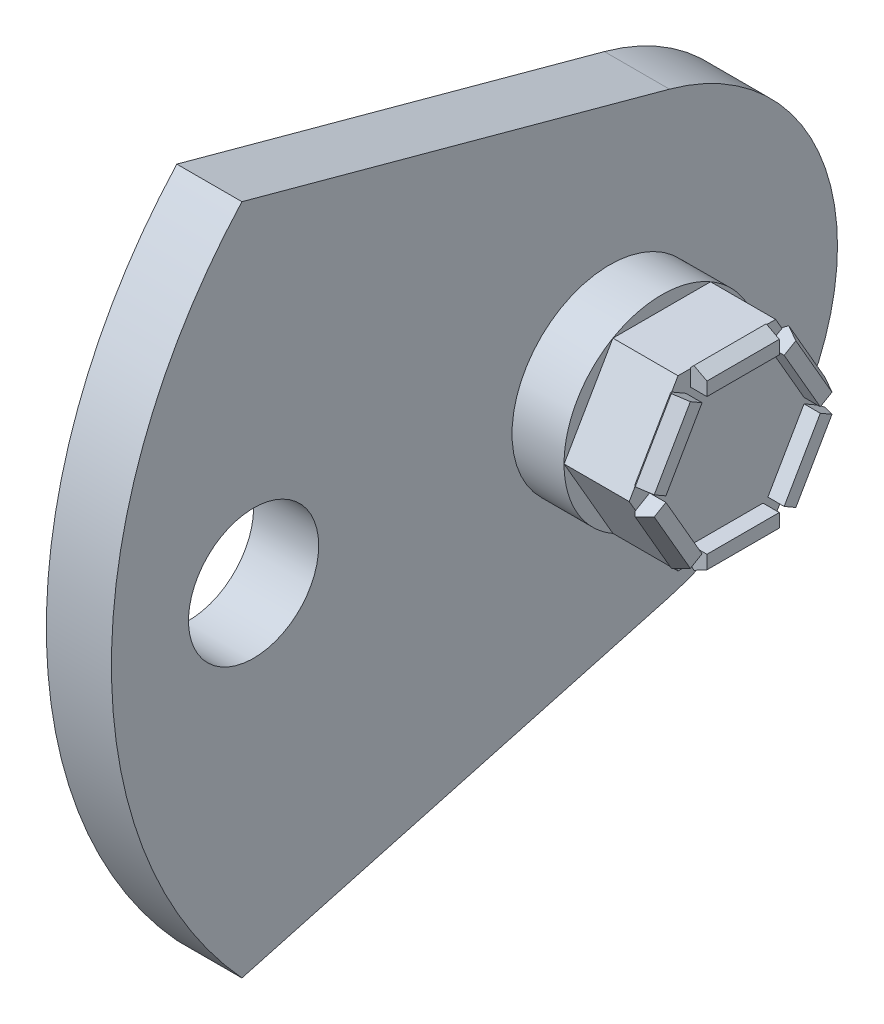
ISO-10303-21;
HEADER;
FILE_DESCRIPTION(('STEP AP214'),'2;1');
FILE_NAME('part.step','',(''),(''),'','','');
FILE_SCHEMA(('AUTOMOTIVE_DESIGN { 1 0 10303 214 1 1 1 1 }'));
ENDSEC;
DATA;
#1=APPLICATION_CONTEXT('core data for automotive mechanical design processes');
#2=APPLICATION_PROTOCOL_DEFINITION('international standard','automotive_design',2000,#1);
#3=PRODUCT_CONTEXT('',#1,'mechanical');
#4=PRODUCT('Part','Part','',(#3));
#5=PRODUCT_RELATED_PRODUCT_CATEGORY('part','',(#4));
#6=PRODUCT_DEFINITION_FORMATION('','',#4);
#7=PRODUCT_DEFINITION_CONTEXT('part definition',#1,'design');
#8=PRODUCT_DEFINITION('design','',#6,#7);
#9=PRODUCT_DEFINITION_SHAPE('','',#8);
#10=(LENGTH_UNIT() NAMED_UNIT(*) SI_UNIT(.MILLI.,.METRE.));
#11=(NAMED_UNIT(*) PLANE_ANGLE_UNIT() SI_UNIT($,.RADIAN.));
#12=(NAMED_UNIT(*) SI_UNIT($,.STERADIAN.) SOLID_ANGLE_UNIT());
#13=UNCERTAINTY_MEASURE_WITH_UNIT(LENGTH_MEASURE(1.E-05),#10,'distance_accuracy_value','');
#14=(GEOMETRIC_REPRESENTATION_CONTEXT(3) GLOBAL_UNCERTAINTY_ASSIGNED_CONTEXT((#13)) GLOBAL_UNIT_ASSIGNED_CONTEXT((#10,
#11,#12)) REPRESENTATION_CONTEXT('',''));
#15=CARTESIAN_POINT('',(0.,0.,0.));
#16=DIRECTION('',(0.,0.,1.));
#17=DIRECTION('',(1.,0.,0.));
#18=AXIS2_PLACEMENT_3D('',#15,#16,#17);
#19=CARTESIAN_POINT('',(11.2,0.,0.));
#20=DIRECTION('',(1.,0.,0.));
#21=DIRECTION('',(0.,0.,-1.));
#22=AXIS2_PLACEMENT_3D('',#19,#20,#21);
#23=PLANE('',#22);
#24=DIRECTION('',(0.,0.866025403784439,-0.5));
#25=VECTOR('',#24,1.);
#26=CARTESIAN_POINT('',(11.2,-5.195,-11.4124381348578));
#27=LINE('',#26,#25);
#28=CARTESIAN_POINT('',(11.2,-5.195,-11.4124381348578));
#29=VERTEX_POINT('',#28);
#30=CARTESIAN_POINT('',(11.2,-4.52179491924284,-11.8011132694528));
#31=VERTEX_POINT('',#30);
#32=EDGE_CURVE('E517',#29,#31,#27,.T.);
#33=ORIENTED_EDGE('',*,*,#32,.T.);
#34=DIRECTION('',(0.,-0.500000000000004,-0.866025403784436));
#35=VECTOR('',#34,1.);
#36=CARTESIAN_POINT('',(11.2,1.71868575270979,-0.992283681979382));
#37=LINE('',#36,#35);
#38=CARTESIAN_POINT('',(11.2,-4.02179491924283,-10.9350878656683));
#39=VERTEX_POINT('',#38);
#40=EDGE_CURVE('E365',#39,#31,#37,.T.);
#41=ORIENTED_EDGE('',*,*,#40,.F.);
#42=DIRECTION('',(0.,0.866025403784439,-0.5));
#43=VECTOR('',#42,1.);
#44=CARTESIAN_POINT('',(11.2,-5.74048067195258,-9.94280418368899));
#45=LINE('',#44,#43);
#46=CARTESIAN_POINT('',(11.2,-0.173205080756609,-13.1570722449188));
#47=VERTEX_POINT('',#46);
#48=EDGE_CURVE('E338',#39,#47,#45,.T.);
#49=ORIENTED_EDGE('',*,*,#48,.T.);
#50=DIRECTION('',(0.,-0.500000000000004,-0.866025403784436));
#51=VECTOR('',#50,1.);
#52=CARTESIAN_POINT('',(11.2,5.567275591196,-3.21426806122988));
#53=LINE('',#52,#51);
#54=CARTESIAN_POINT('',(11.2,-0.673205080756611,-14.0230976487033));
#55=VERTEX_POINT('',#54);
#56=EDGE_CURVE('E356',#47,#55,#53,.T.);
#57=ORIENTED_EDGE('',*,*,#56,.T.);
#58=CARTESIAN_POINT('',(11.2,0.,-14.4117727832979));
#59=VERTEX_POINT('',#58);
#60=EDGE_CURVE('E515',#55,#59,#27,.T.);
#61=ORIENTED_EDGE('',*,*,#60,.T.);
#62=DIRECTION('',(0.,0.866025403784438,0.5));
#63=VECTOR('',#62,1.);
#64=CARTESIAN_POINT('',(11.2,0.,-14.4117727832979));
#65=LINE('',#64,#63);
#66=CARTESIAN_POINT('',(11.2,0.673205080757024,-14.023097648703));
#67=VERTEX_POINT('',#66);
#68=EDGE_CURVE('E492',#59,#67,#65,.T.);
#69=ORIENTED_EDGE('',*,*,#68,.T.);
#70=DIRECTION('',(0.,0.499999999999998,-0.86602540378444));
#71=VECTOR('',#70,1.);
#72=CARTESIAN_POINT('',(11.2,-5.56727559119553,-3.21426806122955));
#73=LINE('',#72,#71);
#74=CARTESIAN_POINT('',(11.2,0.17320508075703,-13.1570722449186));
#75=VERTEX_POINT('',#74);
#76=EDGE_CURVE('E455',#75,#67,#73,.T.);
#77=ORIENTED_EDGE('',*,*,#76,.F.);
#78=DIRECTION('',(0.,0.866025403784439,0.5));
#79=VECTOR('',#78,1.);
#80=CARTESIAN_POINT('',(11.2,5.74048067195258,-9.942804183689));
#81=LINE('',#80,#79);
#82=CARTESIAN_POINT('',(11.2,4.02179491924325,-10.9350878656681));
#83=VERTEX_POINT('',#82);
#84=EDGE_CURVE('E441',#75,#83,#81,.T.);
#85=ORIENTED_EDGE('',*,*,#84,.T.);
#86=DIRECTION('',(0.,0.499999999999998,-0.86602540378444));
#87=VECTOR('',#86,1.);
#88=CARTESIAN_POINT('',(11.2,-1.7186857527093,-0.992283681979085));
#89=LINE('',#88,#87);
#90=CARTESIAN_POINT('',(11.2,4.52179491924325,-11.8011132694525));
#91=VERTEX_POINT('',#90);
#92=EDGE_CURVE('E446',#83,#91,#89,.T.);
#93=ORIENTED_EDGE('',*,*,#92,.T.);
#94=CARTESIAN_POINT('',(11.2,5.195,-11.4124381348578));
#95=VERTEX_POINT('',#94);
#96=EDGE_CURVE('E491',#91,#95,#65,.T.);
#97=ORIENTED_EDGE('',*,*,#96,.T.);
#98=DIRECTION('',(0.,0.,1.));
#99=VECTOR('',#98,1.);
#100=CARTESIAN_POINT('',(11.2,5.195,-11.4124381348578));
#101=LINE('',#100,#99);
#102=CARTESIAN_POINT('',(11.2,5.195,-10.6350878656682));
#103=VERTEX_POINT('',#102);
#104=EDGE_CURVE('E497',#95,#103,#101,.T.);
#105=ORIENTED_EDGE('',*,*,#104,.T.);
#106=DIRECTION('',(0.,1.,0.));
#107=VECTOR('',#106,1.);
#108=CARTESIAN_POINT('',(11.2,0.,-10.6350878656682));
#109=LINE('',#108,#107);
#110=CARTESIAN_POINT('',(11.2,4.195,-10.6350878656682));
#111=VERTEX_POINT('',#110);
#112=EDGE_CURVE('E471',#111,#103,#109,.T.);
#113=ORIENTED_EDGE('',*,*,#112,.F.);
#114=DIRECTION('',(0.,0.,1.));
#115=VECTOR('',#114,1.);
#116=CARTESIAN_POINT('',(11.2,4.195,0.));
#117=LINE('',#116,#115);
#118=CARTESIAN_POINT('',(11.2,4.195,-6.19111910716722));
#119=VERTEX_POINT('',#118);
#120=EDGE_CURVE('E481',#111,#119,#117,.T.);
#121=ORIENTED_EDGE('',*,*,#120,.T.);
#122=DIRECTION('',(0.,1.,0.));
#123=VECTOR('',#122,1.);
#124=CARTESIAN_POINT('',(11.2,0.,-6.19111910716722));
#125=LINE('',#124,#123);
#126=CARTESIAN_POINT('',(11.2,5.195,-6.19111910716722));
#127=VERTEX_POINT('',#126);
#128=EDGE_CURVE('E478',#119,#127,#125,.T.);
#129=ORIENTED_EDGE('',*,*,#128,.T.);
#130=CARTESIAN_POINT('',(11.2,5.195,-5.41376883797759));
#131=VERTEX_POINT('',#130);
#132=EDGE_CURVE('E495',#127,#131,#101,.T.);
#133=ORIENTED_EDGE('',*,*,#132,.T.);
#134=DIRECTION('',(0.,-0.866025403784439,0.5));
#135=VECTOR('',#134,1.);
#136=CARTESIAN_POINT('',(11.2,5.195,-5.41376883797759));
#137=LINE('',#136,#135);
#138=CARTESIAN_POINT('',(11.2,4.52179491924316,-5.02509370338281));
#139=VERTEX_POINT('',#138);
#140=EDGE_CURVE('E502',#131,#139,#137,.T.);
#141=ORIENTED_EDGE('',*,*,#140,.T.);
#142=DIRECTION('',(0.,0.50000000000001,0.866025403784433));
#143=VECTOR('',#142,1.);
#144=CARTESIAN_POINT('',(11.2,5.56727559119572,-3.21426806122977));
#145=LINE('',#144,#143);
#146=CARTESIAN_POINT('',(11.2,4.02179491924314,-5.89111910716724));
#147=VERTEX_POINT('',#146);
#148=EDGE_CURVE('E430',#147,#139,#145,.T.);
#149=ORIENTED_EDGE('',*,*,#148,.F.);
#150=DIRECTION('',(0.,-0.866025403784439,0.5));
#151=VECTOR('',#150,1.);
#152=CARTESIAN_POINT('',(11.2,-1.54548067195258,-2.67685104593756));
#153=LINE('',#152,#151);
#154=CARTESIAN_POINT('',(11.2,0.173205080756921,-3.66913472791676));
#155=VERTEX_POINT('',#154);
#156=EDGE_CURVE('E417',#147,#155,#153,.T.);
#157=ORIENTED_EDGE('',*,*,#156,.T.);
#158=DIRECTION('',(0.,0.500000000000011,0.866025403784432));
#159=VECTOR('',#158,1.);
#160=CARTESIAN_POINT('',(11.2,1.71868575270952,-0.992283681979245));
#161=LINE('',#160,#159);
#162=CARTESIAN_POINT('',(11.2,0.673205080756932,-2.80310932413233));
#163=VERTEX_POINT('',#162);
#164=EDGE_CURVE('E422',#155,#163,#161,.T.);
#165=ORIENTED_EDGE('',*,*,#164,.T.);
#166=CARTESIAN_POINT('',(11.2,0.,-2.41443418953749));
#167=VERTEX_POINT('',#166);
#168=EDGE_CURVE('E500',#163,#167,#137,.T.);
#169=ORIENTED_EDGE('',*,*,#168,.T.);
#170=DIRECTION('',(0.,-0.866025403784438,-0.5));
#171=VECTOR('',#170,1.);
#172=CARTESIAN_POINT('',(11.2,0.,-2.41443418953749));
#173=LINE('',#172,#171);
#174=CARTESIAN_POINT('',(11.2,-0.673205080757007,-2.80310932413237));
#175=VERTEX_POINT('',#174);
#176=EDGE_CURVE('E507',#167,#175,#173,.T.);
#177=ORIENTED_EDGE('',*,*,#176,.T.);
#178=DIRECTION('',(0.,-0.499999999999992,0.866025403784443));
#179=VECTOR('',#178,1.);
#180=CARTESIAN_POINT('',(11.2,-1.71868575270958,-0.992283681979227));
#181=LINE('',#180,#179);
#182=CARTESIAN_POINT('',(11.2,-0.173205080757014,-3.66913472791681));
#183=VERTEX_POINT('',#182);
#184=EDGE_CURVE('E397',#183,#175,#181,.T.);
#185=ORIENTED_EDGE('',*,*,#184,.F.);
#186=DIRECTION('',(0.,-0.866025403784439,-0.5));
#187=VECTOR('',#186,1.);
#188=CARTESIAN_POINT('',(11.2,1.54548067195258,-2.67685104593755));
#189=LINE('',#188,#187);
#190=CARTESIAN_POINT('',(11.2,-4.02179491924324,-5.89111910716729));
#191=VERTEX_POINT('',#190);
#192=EDGE_CURVE('E407',#183,#191,#189,.T.);
#193=ORIENTED_EDGE('',*,*,#192,.T.);
#194=DIRECTION('',(0.,-0.499999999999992,0.866025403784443));
#195=VECTOR('',#194,1.);
#196=CARTESIAN_POINT('',(11.2,-5.56727559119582,-3.21426806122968));
#197=LINE('',#196,#195);
#198=CARTESIAN_POINT('',(11.2,-4.52179491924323,-5.02509370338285));
#199=VERTEX_POINT('',#198);
#200=EDGE_CURVE('E404',#191,#199,#197,.T.);
#201=ORIENTED_EDGE('',*,*,#200,.T.);
#202=CARTESIAN_POINT('',(11.2,-5.195,-5.4137688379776));
#203=VERTEX_POINT('',#202);
#204=EDGE_CURVE('E505',#199,#203,#173,.T.);
#205=ORIENTED_EDGE('',*,*,#204,.T.);
#206=DIRECTION('',(0.,0.,-1.));
#207=VECTOR('',#206,1.);
#208=CARTESIAN_POINT('',(11.2,-5.195,-5.4137688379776));
#209=LINE('',#208,#207);
#210=CARTESIAN_POINT('',(11.2,-5.195,-6.19111910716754));
#211=VERTEX_POINT('',#210);
#212=EDGE_CURVE('E512',#203,#211,#209,.T.);
#213=ORIENTED_EDGE('',*,*,#212,.T.);
#214=DIRECTION('',(0.,-1.,0.));
#215=VECTOR('',#214,1.);
#216=CARTESIAN_POINT('',(11.2,0.,-6.19111910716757));
#217=LINE('',#216,#215);
#218=CARTESIAN_POINT('',(11.2,-4.195,-6.19111910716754));
#219=VERTEX_POINT('',#218);
#220=EDGE_CURVE('E372',#219,#211,#217,.T.);
#221=ORIENTED_EDGE('',*,*,#220,.F.);
#222=DIRECTION('',(0.,0.,-1.));
#223=VECTOR('',#222,1.);
#224=CARTESIAN_POINT('',(11.2,-4.195,0.));
#225=LINE('',#224,#223);
#226=CARTESIAN_POINT('',(11.2,-4.195,-10.6350878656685));
#227=VERTEX_POINT('',#226);
#228=EDGE_CURVE('E382',#219,#227,#225,.T.);
#229=ORIENTED_EDGE('',*,*,#228,.T.);
#230=DIRECTION('',(0.,-1.,0.));
#231=VECTOR('',#230,1.);
#232=CARTESIAN_POINT('',(11.2,0.,-10.6350878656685));
#233=LINE('',#232,#231);
#234=CARTESIAN_POINT('',(11.2,-5.195,-10.6350878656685));
#235=VERTEX_POINT('',#234);
#236=EDGE_CURVE('E379',#227,#235,#233,.T.);
#237=ORIENTED_EDGE('',*,*,#236,.T.);
#238=EDGE_CURVE('E510',#235,#29,#209,.T.);
#239=ORIENTED_EDGE('',*,*,#238,.T.);
#240=EDGE_LOOP('',(#33,#41,#49,#57,#61,#69,#77,#85,#93,#97,#105,#113,#121,#129,#133,#141,#149,
#157,#165,#169,#177,#185,#193,#201,#205,#213,#221,#229,#237,#239));
#241=FACE_BOUND('',#240,.T.);
#242=ADVANCED_FACE('F38',(#241),#23,.T.);
#243=CARTESIAN_POINT('',(7.2,0.,-8.4131034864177));
#244=DIRECTION('',(1.,0.,0.));
#245=DIRECTION('',(0.,0.,-1.));
#246=AXIS2_PLACEMENT_3D('',#243,#244,#245);
#247=PLANE('',#246);
#248=CARTESIAN_POINT('',(7.2,0.,-8.4131034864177));
#249=DIRECTION('',(1.,0.,0.));
#250=DIRECTION('',(0.,0.,-1.));
#251=AXIS2_PLACEMENT_3D('',#248,#249,#250);
#252=CIRCLE('',#251,6.);
#253=CARTESIAN_POINT('',(7.2,0.,-14.4131034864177));
#254=VERTEX_POINT('',#253);
#255=EDGE_CURVE('E538',#254,#254,#252,.T.);
#256=ORIENTED_EDGE('',*,*,#255,.T.);
#257=EDGE_LOOP('',(#256));
#258=FACE_BOUND('',#257,.T.);
#259=DIRECTION('',(0.,0.,-1.));
#260=VECTOR('',#259,1.);
#261=CARTESIAN_POINT('',(7.2,5.195,-8.4131034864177));
#262=LINE('',#261,#260);
#263=CARTESIAN_POINT('',(7.2,5.195,-5.41376883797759));
#264=VERTEX_POINT('',#263);
#265=CARTESIAN_POINT('',(7.2,5.195,-11.4124381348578));
#266=VERTEX_POINT('',#265);
#267=EDGE_CURVE('E592',#264,#266,#262,.T.);
#268=ORIENTED_EDGE('',*,*,#267,.T.);
#269=DIRECTION('',(0.,-0.866025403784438,-0.5));
#270=VECTOR('',#269,1.);
#271=CARTESIAN_POINT('',(7.2,2.5975,-12.9121054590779));
#272=LINE('',#271,#270);
#273=CARTESIAN_POINT('',(7.2,0.,-14.4117727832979));
#274=VERTEX_POINT('',#273);
#275=EDGE_CURVE('E595',#266,#274,#272,.T.);
#276=ORIENTED_EDGE('',*,*,#275,.T.);
#277=DIRECTION('',(0.,-0.866025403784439,0.5));
#278=VECTOR('',#277,1.);
#279=CARTESIAN_POINT('',(7.2,-2.5975,-12.9121054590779));
#280=LINE('',#279,#278);
#281=CARTESIAN_POINT('',(7.2,-5.195,-11.4124381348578));
#282=VERTEX_POINT('',#281);
#283=EDGE_CURVE('E580',#274,#282,#280,.T.);
#284=ORIENTED_EDGE('',*,*,#283,.T.);
#285=DIRECTION('',(0.,0.,1.));
#286=VECTOR('',#285,1.);
#287=CARTESIAN_POINT('',(7.2,-5.195,-8.4131034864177));
#288=LINE('',#287,#286);
#289=CARTESIAN_POINT('',(7.2,-5.195,-5.4137688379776));
#290=VERTEX_POINT('',#289);
#291=EDGE_CURVE('E583',#282,#290,#288,.T.);
#292=ORIENTED_EDGE('',*,*,#291,.T.);
#293=DIRECTION('',(0.,0.866025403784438,0.5));
#294=VECTOR('',#293,1.);
#295=CARTESIAN_POINT('',(7.2,-2.5975,-3.91410151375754));
#296=LINE('',#295,#294);
#297=CARTESIAN_POINT('',(7.2,0.,-2.41443418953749));
#298=VERTEX_POINT('',#297);
#299=EDGE_CURVE('E586',#290,#298,#296,.T.);
#300=ORIENTED_EDGE('',*,*,#299,.T.);
#301=DIRECTION('',(0.,0.866025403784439,-0.5));
#302=VECTOR('',#301,1.);
#303=CARTESIAN_POINT('',(7.2,2.5975,-3.91410151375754));
#304=LINE('',#303,#302);
#305=EDGE_CURVE('E589',#298,#264,#304,.T.);
#306=ORIENTED_EDGE('',*,*,#305,.T.);
#307=EDGE_LOOP('',(#268,#276,#284,#292,#300,#306));
#308=FACE_BOUND('',#307,.T.);
#309=ADVANCED_FACE('F763',(#258,#308),#247,.T.);
#310=CARTESIAN_POINT('',(4.,15.6400441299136,-4.25472608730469));
#311=DIRECTION('',(0.,-0.964931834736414,0.262500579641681));
#312=DIRECTION('',(0.,-0.262500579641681,-0.964931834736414));
#313=AXIS2_PLACEMENT_3D('',#310,#311,#312);
#314=PLANE('',#313);
#315=DIRECTION('',(0.,0.262500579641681,0.964931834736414));
#316=VECTOR('',#315,1.);
#317=CARTESIAN_POINT('',(0.,15.6400441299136,-4.25472608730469));
#318=LINE('',#317,#316);
#319=CARTESIAN_POINT('',(0.,13.5090456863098,-12.0881116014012));
#320=VERTEX_POINT('',#319);
#321=CARTESIAN_POINT('',(0.,20.6562419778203,14.184429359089));
#322=VERTEX_POINT('',#321);
#323=EDGE_CURVE('E541',#320,#322,#318,.T.);
#324=ORIENTED_EDGE('',*,*,#323,.T.);
#325=DIRECTION('',(-1.,0.,0.));
#326=VECTOR('',#325,1.);
#327=CARTESIAN_POINT('',(4.,20.6562419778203,14.184429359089));
#328=LINE('',#327,#326);
#329=CARTESIAN_POINT('',(4.,20.6562419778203,14.184429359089));
#330=VERTEX_POINT('',#329);
#331=EDGE_CURVE('E577',#330,#322,#328,.T.);
#332=ORIENTED_EDGE('',*,*,#331,.F.);
#333=DIRECTION('',(0.,0.262500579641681,0.964931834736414));
#334=VECTOR('',#333,1.);
#335=CARTESIAN_POINT('',(4.,15.6400441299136,-4.25472608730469));
#336=LINE('',#335,#334);
#337=CARTESIAN_POINT('',(4.,13.5090456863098,-12.0881116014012));
#338=VERTEX_POINT('',#337);
#339=EDGE_CURVE('E545',#338,#330,#336,.T.);
#340=ORIENTED_EDGE('',*,*,#339,.F.);
#341=DIRECTION('',(-1.,0.,0.));
#342=VECTOR('',#341,1.);
#343=CARTESIAN_POINT('',(4.,13.5090456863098,-12.0881116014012));
#344=LINE('',#343,#342);
#345=EDGE_CURVE('E558',#338,#320,#344,.T.);
#346=ORIENTED_EDGE('',*,*,#345,.T.);
#347=EDGE_LOOP('',(#324,#332,#340,#346));
#348=FACE_BOUND('',#347,.T.);
#349=ADVANCED_FACE('F806',(#348),#314,.F.);
#350=CARTESIAN_POINT('',(4.,0.,-8.4131034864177));
#351=DIRECTION('',(-1.,0.,0.));
#352=DIRECTION('',(0.,0.,1.));
#353=AXIS2_PLACEMENT_3D('',#350,#351,#352);
#354=CYLINDRICAL_SURFACE('',#353,30.6158263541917);
#355=CARTESIAN_POINT('',(0.,0.,-8.4131034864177));
#356=DIRECTION('',(1.,0.,0.));
#357=DIRECTION('',(0.,0.,-1.));
#358=AXIS2_PLACEMENT_3D('',#355,#356,#357);
#359=CIRCLE('',#358,30.6158263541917);
#360=CARTESIAN_POINT('',(0.,-20.6562419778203,14.184429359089));
#361=VERTEX_POINT('',#360);
#362=EDGE_CURVE('E561',#322,#361,#359,.T.);
#363=ORIENTED_EDGE('',*,*,#362,.T.);
#364=DIRECTION('',(-1.,0.,0.));
#365=VECTOR('',#364,1.);
#366=CARTESIAN_POINT('',(4.,-20.6562419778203,14.184429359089));
#367=LINE('',#366,#365);
#368=CARTESIAN_POINT('',(4.,-20.6562419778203,14.184429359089));
#369=VERTEX_POINT('',#368);
#370=EDGE_CURVE('E574',#369,#361,#367,.T.);
#371=ORIENTED_EDGE('',*,*,#370,.F.);
#372=CARTESIAN_POINT('',(4.,0.,-8.4131034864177));
#373=DIRECTION('',(1.,0.,0.));
#374=DIRECTION('',(0.,0.,-1.));
#375=AXIS2_PLACEMENT_3D('',#372,#373,#374);
#376=CIRCLE('',#375,30.6158263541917);
#377=EDGE_CURVE('E549',#330,#369,#376,.T.);
#378=ORIENTED_EDGE('',*,*,#377,.F.);
#379=ORIENTED_EDGE('',*,*,#331,.T.);
#380=EDGE_LOOP('',(#363,#371,#378,#379));
#381=FACE_BOUND('',#380,.T.);
#382=ADVANCED_FACE('F846',(#381),#354,.T.);
#383=CARTESIAN_POINT('',(4.,-15.6400441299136,-4.2547260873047));
#384=DIRECTION('',(0.,0.964931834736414,0.262500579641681));
#385=DIRECTION('',(0.,-0.262500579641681,0.964931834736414));
#386=AXIS2_PLACEMENT_3D('',#383,#384,#385);
#387=PLANE('',#386);
#388=DIRECTION('',(0.,0.262500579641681,-0.964931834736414));
#389=VECTOR('',#388,1.);
#390=CARTESIAN_POINT('',(0.,-15.6400441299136,-4.2547260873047));
#391=LINE('',#390,#389);
#392=CARTESIAN_POINT('',(0.,-13.5090456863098,-12.0881116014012));
#393=VERTEX_POINT('',#392);
#394=EDGE_CURVE('E563',#361,#393,#391,.T.);
#395=ORIENTED_EDGE('',*,*,#394,.T.);
#396=DIRECTION('',(-1.,0.,0.));
#397=VECTOR('',#396,1.);
#398=CARTESIAN_POINT('',(4.,-13.5090456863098,-12.0881116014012));
#399=LINE('',#398,#397);
#400=CARTESIAN_POINT('',(4.,-13.5090456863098,-12.0881116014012));
#401=VERTEX_POINT('',#400);
#402=EDGE_CURVE('E571',#401,#393,#399,.T.);
#403=ORIENTED_EDGE('',*,*,#402,.F.);
#404=DIRECTION('',(0.,0.262500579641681,-0.964931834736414));
#405=VECTOR('',#404,1.);
#406=CARTESIAN_POINT('',(4.,-15.6400441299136,-4.2547260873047));
#407=LINE('',#406,#405);
#408=EDGE_CURVE('E551',#369,#401,#407,.T.);
#409=ORIENTED_EDGE('',*,*,#408,.F.);
#410=ORIENTED_EDGE('',*,*,#370,.T.);
#411=EDGE_LOOP('',(#395,#403,#409,#410));
#412=FACE_BOUND('',#411,.T.);
#413=ADVANCED_FACE('F842',(#412),#387,.F.);
#414=CARTESIAN_POINT('',(4.,0.,-8.4131034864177));
#415=DIRECTION('',(-1.,0.,0.));
#416=DIRECTION('',(0.,0.,1.));
#417=AXIS2_PLACEMENT_3D('',#414,#415,#416);
#418=CYLINDRICAL_SURFACE('',#417,14.);
#419=CARTESIAN_POINT('',(0.,0.,-8.4131034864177));
#420=DIRECTION('',(1.,0.,0.));
#421=DIRECTION('',(0.,0.,-1.));
#422=AXIS2_PLACEMENT_3D('',#419,#420,#421);
#423=CIRCLE('',#422,14.);
#424=EDGE_CURVE('E565',#393,#320,#423,.T.);
#425=ORIENTED_EDGE('',*,*,#424,.T.);
#426=ORIENTED_EDGE('',*,*,#345,.F.);
#427=CARTESIAN_POINT('',(4.,0.,-8.4131034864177));
#428=DIRECTION('',(1.,0.,0.));
#429=DIRECTION('',(0.,0.,-1.));
#430=AXIS2_PLACEMENT_3D('',#427,#428,#429);
#431=CIRCLE('',#430,14.);
#432=EDGE_CURVE('E553',#401,#338,#431,.T.);
#433=ORIENTED_EDGE('',*,*,#432,.F.);
#434=ORIENTED_EDGE('',*,*,#402,.T.);
#435=EDGE_LOOP('',(#425,#426,#433,#434));
#436=FACE_BOUND('',#435,.T.);
#437=ADVANCED_FACE('F838',(#436),#418,.T.);
#438=CARTESIAN_POINT('',(4.,0.,13.4668965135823));
#439=DIRECTION('',(-1.,0.,0.));
#440=DIRECTION('',(0.,0.,1.));
#441=AXIS2_PLACEMENT_3D('',#438,#439,#440);
#442=CYLINDRICAL_SURFACE('',#441,4.);
#443=CARTESIAN_POINT('',(4.,0.,13.4668965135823));
#444=DIRECTION('',(1.,0.,0.));
#445=DIRECTION('',(0.,0.,-1.));
#446=AXIS2_PLACEMENT_3D('',#443,#444,#445);
#447=CIRCLE('',#446,4.);
#448=CARTESIAN_POINT('',(4.,0.,9.4668965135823));
#449=VERTEX_POINT('',#448);
#450=EDGE_CURVE('E555',#449,#449,#447,.T.);
#451=ORIENTED_EDGE('',*,*,#450,.T.);
#452=EDGE_LOOP('',(#451));
#453=FACE_BOUND('',#452,.T.);
#454=CARTESIAN_POINT('',(0.,0.,13.4668965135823));
#455=DIRECTION('',(1.,0.,0.));
#456=DIRECTION('',(0.,0.,-1.));
#457=AXIS2_PLACEMENT_3D('',#454,#455,#456);
#458=CIRCLE('',#457,4.);
#459=CARTESIAN_POINT('',(0.,0.,9.4668965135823));
#460=VERTEX_POINT('',#459);
#461=EDGE_CURVE('E546',#460,#460,#458,.T.);
#462=ORIENTED_EDGE('',*,*,#461,.F.);
#463=EDGE_LOOP('',(#462));
#464=FACE_BOUND('',#463,.T.);
#465=ADVANCED_FACE('F831',(#453,#464),#442,.F.);
#466=CARTESIAN_POINT('',(4.,0.,0.));
#467=DIRECTION('',(1.,0.,0.));
#468=DIRECTION('',(0.,0.,-1.));
#469=AXIS2_PLACEMENT_3D('',#466,#467,#468);
#470=PLANE('',#469);
#471=CARTESIAN_POINT('',(4.,0.,-8.4131034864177));
#472=DIRECTION('',(1.,0.,0.));
#473=DIRECTION('',(0.,0.,-1.));
#474=AXIS2_PLACEMENT_3D('',#471,#472,#473);
#475=CIRCLE('',#474,6.);
#476=CARTESIAN_POINT('',(4.,0.,-14.4131034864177));
#477=VERTEX_POINT('',#476);
#478=EDGE_CURVE('E542',#477,#477,#475,.T.);
#479=ORIENTED_EDGE('',*,*,#478,.F.);
#480=EDGE_LOOP('',(#479));
#481=FACE_BOUND('',#480,.T.);
#482=ORIENTED_EDGE('',*,*,#339,.T.);
#483=ORIENTED_EDGE('',*,*,#377,.T.);
#484=ORIENTED_EDGE('',*,*,#408,.T.);
#485=ORIENTED_EDGE('',*,*,#432,.T.);
#486=EDGE_LOOP('',(#482,#483,#484,#485));
#487=FACE_BOUND('',#486,.T.);
#488=ORIENTED_EDGE('',*,*,#450,.F.);
#489=EDGE_LOOP('',(#488));
#490=FACE_BOUND('',#489,.T.);
#491=ADVANCED_FACE('F828',(#481,#487,#490),#470,.T.);
#492=CARTESIAN_POINT('',(0.,0.,0.));
#493=DIRECTION('',(1.,0.,0.));
#494=DIRECTION('',(0.,0.,-1.));
#495=AXIS2_PLACEMENT_3D('',#492,#493,#494);
#496=PLANE('',#495);
#497=ORIENTED_EDGE('',*,*,#461,.T.);
#498=EDGE_LOOP('',(#497));
#499=FACE_BOUND('',#498,.T.);
#500=ORIENTED_EDGE('',*,*,#323,.F.);
#501=ORIENTED_EDGE('',*,*,#424,.F.);
#502=ORIENTED_EDGE('',*,*,#394,.F.);
#503=ORIENTED_EDGE('',*,*,#362,.F.);
#504=EDGE_LOOP('',(#500,#501,#502,#503));
#505=FACE_BOUND('',#504,.T.);
#506=ADVANCED_FACE('F826',(#499,#505),#496,.F.);
#507=CARTESIAN_POINT('',(7.2,0.,-8.4131034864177));
#508=DIRECTION('',(-1.,0.,0.));
#509=DIRECTION('',(0.,0.,1.));
#510=AXIS2_PLACEMENT_3D('',#507,#508,#509);
#511=CYLINDRICAL_SURFACE('',#510,6.);
#512=ORIENTED_EDGE('',*,*,#478,.T.);
#513=EDGE_LOOP('',(#512));
#514=FACE_BOUND('',#513,.T.);
#515=ORIENTED_EDGE('',*,*,#255,.F.);
#516=EDGE_LOOP('',(#515));
#517=FACE_BOUND('',#516,.T.);
#518=ADVANCED_FACE('F822',(#514,#517),#511,.T.);
#519=CARTESIAN_POINT('',(11.2,0.,-14.4117727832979));
#520=DIRECTION('',(0.,-0.5,0.866025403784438));
#521=DIRECTION('',(0.,-0.866025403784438,-0.5));
#522=AXIS2_PLACEMENT_3D('',#519,#520,#521);
#523=PLANE('',#522);
#524=ORIENTED_EDGE('',*,*,#275,.F.);
#525=DIRECTION('',(-1.,0.,0.));
#526=VECTOR('',#525,1.);
#527=CARTESIAN_POINT('',(11.2,5.195,-11.4124381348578));
#528=LINE('',#527,#526);
#529=EDGE_CURVE('E535',#95,#266,#528,.T.);
#530=ORIENTED_EDGE('',*,*,#529,.F.);
#531=ORIENTED_EDGE('',*,*,#96,.F.);
#532=EDGE_CURVE('E496',#67,#91,#65,.T.);
#533=ORIENTED_EDGE('',*,*,#532,.F.);
#534=ORIENTED_EDGE('',*,*,#68,.F.);
#535=DIRECTION('',(-1.,0.,0.));
#536=VECTOR('',#535,1.);
#537=CARTESIAN_POINT('',(11.2,0.,-14.4117727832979));
#538=LINE('',#537,#536);
#539=EDGE_CURVE('E520',#59,#274,#538,.T.);
#540=ORIENTED_EDGE('',*,*,#539,.T.);
#541=EDGE_LOOP('',(#524,#530,#531,#533,#534,#540));
#542=FACE_BOUND('',#541,.T.);
#543=ADVANCED_FACE('F750',(#542),#523,.F.);
#544=CARTESIAN_POINT('',(11.2,5.195,-11.4124381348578));
#545=DIRECTION('',(0.,-1.,0.));
#546=DIRECTION('',(0.,0.,-1.));
#547=AXIS2_PLACEMENT_3D('',#544,#545,#546);
#548=PLANE('',#547);
#549=ORIENTED_EDGE('',*,*,#267,.F.);
#550=DIRECTION('',(-1.,0.,0.));
#551=VECTOR('',#550,1.);
#552=CARTESIAN_POINT('',(11.2,5.195,-5.41376883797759));
#553=LINE('',#552,#551);
#554=EDGE_CURVE('E532',#131,#264,#553,.T.);
#555=ORIENTED_EDGE('',*,*,#554,.F.);
#556=ORIENTED_EDGE('',*,*,#132,.F.);
#557=EDGE_CURVE('E501',#103,#127,#101,.T.);
#558=ORIENTED_EDGE('',*,*,#557,.F.);
#559=ORIENTED_EDGE('',*,*,#104,.F.);
#560=ORIENTED_EDGE('',*,*,#529,.T.);
#561=EDGE_LOOP('',(#549,#555,#556,#558,#559,#560));
#562=FACE_BOUND('',#561,.T.);
#563=ADVANCED_FACE('F761',(#562),#548,.F.);
#564=CARTESIAN_POINT('',(11.2,5.195,-5.41376883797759));
#565=DIRECTION('',(0.,-0.5,-0.866025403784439));
#566=DIRECTION('',(0.,0.866025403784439,-0.5));
#567=AXIS2_PLACEMENT_3D('',#564,#565,#566);
#568=PLANE('',#567);
#569=ORIENTED_EDGE('',*,*,#305,.F.);
#570=DIRECTION('',(-1.,0.,0.));
#571=VECTOR('',#570,1.);
#572=CARTESIAN_POINT('',(11.2,0.,-2.41443418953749));
#573=LINE('',#572,#571);
#574=EDGE_CURVE('E529',#167,#298,#573,.T.);
#575=ORIENTED_EDGE('',*,*,#574,.F.);
#576=ORIENTED_EDGE('',*,*,#168,.F.);
#577=EDGE_CURVE('E506',#139,#163,#137,.T.);
#578=ORIENTED_EDGE('',*,*,#577,.F.);
#579=ORIENTED_EDGE('',*,*,#140,.F.);
#580=ORIENTED_EDGE('',*,*,#554,.T.);
#581=EDGE_LOOP('',(#569,#575,#576,#578,#579,#580));
#582=FACE_BOUND('',#581,.T.);
#583=ADVANCED_FACE('F717',(#582),#568,.F.);
#584=CARTESIAN_POINT('',(11.2,0.,-2.41443418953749));
#585=DIRECTION('',(0.,0.5,-0.866025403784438));
#586=DIRECTION('',(0.,0.866025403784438,0.5));
#587=AXIS2_PLACEMENT_3D('',#584,#585,#586);
#588=PLANE('',#587);
#589=ORIENTED_EDGE('',*,*,#299,.F.);
#590=DIRECTION('',(-1.,0.,0.));
#591=VECTOR('',#590,1.);
#592=CARTESIAN_POINT('',(11.2,-5.195,-5.4137688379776));
#593=LINE('',#592,#591);
#594=EDGE_CURVE('E526',#203,#290,#593,.T.);
#595=ORIENTED_EDGE('',*,*,#594,.F.);
#596=ORIENTED_EDGE('',*,*,#204,.F.);
#597=EDGE_CURVE('E511',#175,#199,#173,.T.);
#598=ORIENTED_EDGE('',*,*,#597,.F.);
#599=ORIENTED_EDGE('',*,*,#176,.F.);
#600=ORIENTED_EDGE('',*,*,#574,.T.);
#601=EDGE_LOOP('',(#589,#595,#596,#598,#599,#600));
#602=FACE_BOUND('',#601,.T.);
#603=ADVANCED_FACE('F719',(#602),#588,.F.);
#604=CARTESIAN_POINT('',(11.2,-5.195,-5.4137688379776));
#605=DIRECTION('',(0.,1.,0.));
#606=DIRECTION('',(0.,0.,1.));
#607=AXIS2_PLACEMENT_3D('',#604,#605,#606);
#608=PLANE('',#607);
#609=ORIENTED_EDGE('',*,*,#291,.F.);
#610=DIRECTION('',(-1.,0.,0.));
#611=VECTOR('',#610,1.);
#612=CARTESIAN_POINT('',(11.2,-5.195,-11.4124381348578));
#613=LINE('',#612,#611);
#614=EDGE_CURVE('E524',#29,#282,#613,.T.);
#615=ORIENTED_EDGE('',*,*,#614,.F.);
#616=ORIENTED_EDGE('',*,*,#238,.F.);
#617=EDGE_CURVE('E516',#211,#235,#209,.T.);
#618=ORIENTED_EDGE('',*,*,#617,.F.);
#619=ORIENTED_EDGE('',*,*,#212,.F.);
#620=ORIENTED_EDGE('',*,*,#594,.T.);
#621=EDGE_LOOP('',(#609,#615,#616,#618,#619,#620));
#622=FACE_BOUND('',#621,.T.);
#623=ADVANCED_FACE('F730',(#622),#608,.F.);
#624=CARTESIAN_POINT('',(11.2,-5.195,-11.4124381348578));
#625=DIRECTION('',(0.,0.5,0.866025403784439));
#626=DIRECTION('',(0.,-0.866025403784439,0.5));
#627=AXIS2_PLACEMENT_3D('',#624,#625,#626);
#628=PLANE('',#627);
#629=ORIENTED_EDGE('',*,*,#283,.F.);
#630=ORIENTED_EDGE('',*,*,#539,.F.);
#631=ORIENTED_EDGE('',*,*,#60,.F.);
#632=EDGE_CURVE('E521',#31,#55,#27,.T.);
#633=ORIENTED_EDGE('',*,*,#632,.F.);
#634=ORIENTED_EDGE('',*,*,#32,.F.);
#635=ORIENTED_EDGE('',*,*,#614,.T.);
#636=EDGE_LOOP('',(#629,#630,#631,#633,#634,#635));
#637=FACE_BOUND('',#636,.T.);
#638=ADVANCED_FACE('F740',(#637),#628,.F.);
#639=CARTESIAN_POINT('',(11.2,0.,0.));
#640=DIRECTION('',(1.,0.,0.));
#641=DIRECTION('',(0.,0.,-1.));
#642=AXIS2_PLACEMENT_3D('',#639,#640,#641);
#643=PLANE('',#642);
#644=CARTESIAN_POINT('',(11.2,5.25,-6.19111910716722));
#645=VERTEX_POINT('',#644);
#646=EDGE_CURVE('E466',#127,#645,#125,.T.);
#647=ORIENTED_EDGE('',*,*,#646,.T.);
#648=DIRECTION('',(0.,0.,-1.));
#649=VECTOR('',#648,1.);
#650=CARTESIAN_POINT('',(11.2,5.25,0.));
#651=LINE('',#650,#649);
#652=CARTESIAN_POINT('',(11.2,5.25,-10.6350878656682));
#653=VERTEX_POINT('',#652);
#654=EDGE_CURVE('E611',#645,#653,#651,.T.);
#655=ORIENTED_EDGE('',*,*,#654,.T.);
#656=EDGE_CURVE('E484',#103,#653,#109,.T.);
#657=ORIENTED_EDGE('',*,*,#656,.F.);
#658=ORIENTED_EDGE('',*,*,#557,.T.);
#659=EDGE_LOOP('',(#647,#655,#657,#658));
#660=FACE_BOUND('',#659,.T.);
#661=ADVANCED_FACE('F767',(#660),#643,.F.);
#662=CARTESIAN_POINT('',(12.2,0.,-6.19111910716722));
#663=DIRECTION('',(0.,0.,1.));
#664=DIRECTION('',(1.,0.,0.));
#665=AXIS2_PLACEMENT_3D('',#662,#663,#664);
#666=PLANE('',#665);
#667=DIRECTION('',(0.,1.,0.));
#668=VECTOR('',#667,1.);
#669=CARTESIAN_POINT('',(12.2,0.,-6.19111910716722));
#670=LINE('',#669,#668);
#671=CARTESIAN_POINT('',(12.2,4.195,-6.19111910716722));
#672=VERTEX_POINT('',#671);
#673=CARTESIAN_POINT('',(12.2,5.02463245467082,-6.19111910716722));
#674=VERTEX_POINT('',#673);
#675=EDGE_CURVE('E467',#672,#674,#670,.T.);
#676=ORIENTED_EDGE('',*,*,#675,.T.);
#677=DIRECTION('',(-0.882947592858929,0.469471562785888,0.));
#678=VECTOR('',#677,1.);
#679=CARTESIAN_POINT('',(14.2828045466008,3.91718563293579,-6.19111910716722));
#680=LINE('',#679,#678);
#681=CARTESIAN_POINT('',(11.4,5.45,-6.19111910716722));
#682=VERTEX_POINT('',#681);
#683=EDGE_CURVE('E654',#674,#682,#680,.T.);
#684=ORIENTED_EDGE('',*,*,#683,.T.);
#685=DIRECTION('',(0.707106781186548,0.707106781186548,0.));
#686=VECTOR('',#685,1.);
#687=CARTESIAN_POINT('',(9.075,3.125,-6.19111910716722));
#688=LINE('',#687,#686);
#689=EDGE_CURVE('E609',#682,#645,#688,.F.);
#690=ORIENTED_EDGE('',*,*,#689,.T.);
#691=ORIENTED_EDGE('',*,*,#646,.F.);
#692=ORIENTED_EDGE('',*,*,#128,.F.);
#693=DIRECTION('',(-1.,0.,0.));
#694=VECTOR('',#693,1.);
#695=CARTESIAN_POINT('',(12.2,4.195,-6.19111910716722));
#696=LINE('',#695,#694);
#697=EDGE_CURVE('E488',#672,#119,#696,.T.);
#698=ORIENTED_EDGE('',*,*,#697,.F.);
#699=EDGE_LOOP('',(#676,#684,#690,#691,#692,#698));
#700=FACE_BOUND('',#699,.T.);
#701=ADVANCED_FACE('F771',(#700),#666,.T.);
#702=CARTESIAN_POINT('',(12.2,4.195,0.));
#703=DIRECTION('',(0.,-1.,0.));
#704=DIRECTION('',(0.,0.,-1.));
#705=AXIS2_PLACEMENT_3D('',#702,#703,#704);
#706=PLANE('',#705);
#707=ORIENTED_EDGE('',*,*,#120,.F.);
#708=DIRECTION('',(-1.,0.,0.));
#709=VECTOR('',#708,1.);
#710=CARTESIAN_POINT('',(12.2,4.195,-10.6350878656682));
#711=LINE('',#710,#709);
#712=CARTESIAN_POINT('',(12.2,4.195,-10.6350878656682));
#713=VERTEX_POINT('',#712);
#714=EDGE_CURVE('E477',#713,#111,#711,.T.);
#715=ORIENTED_EDGE('',*,*,#714,.F.);
#716=DIRECTION('',(0.,0.,1.));
#717=VECTOR('',#716,1.);
#718=CARTESIAN_POINT('',(12.2,4.195,0.));
#719=LINE('',#718,#717);
#720=EDGE_CURVE('E470',#713,#672,#719,.T.);
#721=ORIENTED_EDGE('',*,*,#720,.T.);
#722=ORIENTED_EDGE('',*,*,#697,.T.);
#723=EDGE_LOOP('',(#707,#715,#721,#722));
#724=FACE_BOUND('',#723,.T.);
#725=ADVANCED_FACE('F775',(#724),#706,.T.);
#726=CARTESIAN_POINT('',(12.2,0.,-10.6350878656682));
#727=DIRECTION('',(0.,0.,1.));
#728=DIRECTION('',(1.,0.,0.));
#729=AXIS2_PLACEMENT_3D('',#726,#727,#728);
#730=PLANE('',#729);
#731=DIRECTION('',(-0.707106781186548,-0.707106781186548,0.));
#732=VECTOR('',#731,1.);
#733=CARTESIAN_POINT('',(11.4,5.45,-10.6350878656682));
#734=LINE('',#733,#732);
#735=CARTESIAN_POINT('',(11.4,5.45,-10.6350878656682));
#736=VERTEX_POINT('',#735);
#737=EDGE_CURVE('E613',#653,#736,#734,.F.);
#738=ORIENTED_EDGE('',*,*,#737,.T.);
#739=DIRECTION('',(0.882947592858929,-0.469471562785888,0.));
#740=VECTOR('',#739,1.);
#741=CARTESIAN_POINT('',(12.2,5.02463245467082,-10.6350878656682));
#742=LINE('',#741,#740);
#743=CARTESIAN_POINT('',(12.2,5.02463245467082,-10.6350878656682));
#744=VERTEX_POINT('',#743);
#745=EDGE_CURVE('E656',#736,#744,#742,.T.);
#746=ORIENTED_EDGE('',*,*,#745,.T.);
#747=DIRECTION('',(0.,1.,0.));
#748=VECTOR('',#747,1.);
#749=CARTESIAN_POINT('',(12.2,0.,-10.6350878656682));
#750=LINE('',#749,#748);
#751=EDGE_CURVE('E474',#713,#744,#750,.T.);
#752=ORIENTED_EDGE('',*,*,#751,.F.);
#753=ORIENTED_EDGE('',*,*,#714,.T.);
#754=ORIENTED_EDGE('',*,*,#112,.T.);
#755=ORIENTED_EDGE('',*,*,#656,.T.);
#756=EDGE_LOOP('',(#738,#746,#752,#753,#754,#755));
#757=FACE_BOUND('',#756,.T.);
#758=ADVANCED_FACE('F790',(#757),#730,.F.);
#759=CARTESIAN_POINT('',(12.2,0.,0.));
#760=DIRECTION('',(1.,0.,0.));
#761=DIRECTION('',(0.,0.,-1.));
#762=AXIS2_PLACEMENT_3D('',#759,#760,#761);
#763=PLANE('',#762);
#764=ORIENTED_EDGE('',*,*,#751,.T.);
#765=DIRECTION('',(0.,0.,1.));
#766=VECTOR('',#765,1.);
#767=CARTESIAN_POINT('',(12.2,5.02463245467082,-6.19111910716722));
#768=LINE('',#767,#766);
#769=EDGE_CURVE('E651',#744,#674,#768,.T.);
#770=ORIENTED_EDGE('',*,*,#769,.T.);
#771=ORIENTED_EDGE('',*,*,#675,.F.);
#772=ORIENTED_EDGE('',*,*,#720,.F.);
#773=EDGE_LOOP('',(#764,#770,#771,#772));
#774=FACE_BOUND('',#773,.T.);
#775=ADVANCED_FACE('F780',(#774),#763,.T.);
#776=CARTESIAN_POINT('',(11.2,0.,0.));
#777=DIRECTION('',(1.,0.,0.));
#778=DIRECTION('',(0.,0.,-1.));
#779=AXIS2_PLACEMENT_3D('',#776,#777,#778);
#780=PLANE('',#779);
#781=CARTESIAN_POINT('',(11.2,4.54929491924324,-11.8487446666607));
#782=VERTEX_POINT('',#781);
#783=EDGE_CURVE('E458',#91,#782,#89,.T.);
#784=ORIENTED_EDGE('',*,*,#783,.T.);
#785=DIRECTION('',(0.,-0.866025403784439,-0.5));
#786=VECTOR('',#785,1.);
#787=CARTESIAN_POINT('',(11.2,6.26798067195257,-10.8564609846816));
#788=LINE('',#787,#786);
#789=CARTESIAN_POINT('',(11.2,0.700705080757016,-14.0707290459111));
#790=VERTEX_POINT('',#789);
#791=EDGE_CURVE('E620',#782,#790,#788,.T.);
#792=ORIENTED_EDGE('',*,*,#791,.T.);
#793=EDGE_CURVE('E454',#67,#790,#73,.T.);
#794=ORIENTED_EDGE('',*,*,#793,.F.);
#795=ORIENTED_EDGE('',*,*,#532,.T.);
#796=EDGE_LOOP('',(#784,#792,#794,#795));
#797=FACE_BOUND('',#796,.T.);
#798=ADVANCED_FACE('F797',(#797),#780,.F.);
#799=CARTESIAN_POINT('',(12.2,5.74048067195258,-9.942804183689));
#800=DIRECTION('',(0.,-0.5,0.866025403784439));
#801=DIRECTION('',(0.,-0.866025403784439,-0.5));
#802=AXIS2_PLACEMENT_3D('',#799,#800,#801);
#803=PLANE('',#802);
#804=ORIENTED_EDGE('',*,*,#84,.F.);
#805=DIRECTION('',(-1.,0.,0.));
#806=VECTOR('',#805,1.);
#807=CARTESIAN_POINT('',(12.2,0.173205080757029,-13.1570722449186));
#808=LINE('',#807,#806);
#809=CARTESIAN_POINT('',(12.2,0.173205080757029,-13.1570722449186));
#810=VERTEX_POINT('',#809);
#811=EDGE_CURVE('E463',#810,#75,#808,.T.);
#812=ORIENTED_EDGE('',*,*,#811,.F.);
#813=DIRECTION('',(0.,0.866025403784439,0.5));
#814=VECTOR('',#813,1.);
#815=CARTESIAN_POINT('',(12.2,5.74048067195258,-9.942804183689));
#816=LINE('',#815,#814);
#817=CARTESIAN_POINT('',(12.2,4.02179491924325,-10.9350878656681));
#818=VERTEX_POINT('',#817);
#819=EDGE_CURVE('E442',#810,#818,#816,.T.);
#820=ORIENTED_EDGE('',*,*,#819,.T.);
#821=DIRECTION('',(-1.,0.,0.));
#822=VECTOR('',#821,1.);
#823=CARTESIAN_POINT('',(12.2,4.02179491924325,-10.9350878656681));
#824=LINE('',#823,#822);
#825=EDGE_CURVE('E452',#818,#83,#824,.T.);
#826=ORIENTED_EDGE('',*,*,#825,.T.);
#827=EDGE_LOOP('',(#804,#812,#820,#826));
#828=FACE_BOUND('',#827,.T.);
#829=ADVANCED_FACE('F943',(#828),#803,.T.);
#830=CARTESIAN_POINT('',(12.2,-5.56727559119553,-3.21426806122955));
#831=DIRECTION('',(0.,0.86602540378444,0.499999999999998));
#832=DIRECTION('',(0.,-0.499999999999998,0.86602540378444));
#833=AXIS2_PLACEMENT_3D('',#830,#831,#832);
#834=PLANE('',#833);
#835=DIRECTION('',(-0.707106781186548,-0.353553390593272,0.612372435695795));
#836=VECTOR('',#835,1.);
#837=CARTESIAN_POINT('',(11.4,0.800705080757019,-14.243934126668));
#838=LINE('',#837,#836);
#839=CARTESIAN_POINT('',(11.4,0.800705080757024,-14.2439341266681));
#840=VERTEX_POINT('',#839);
#841=EDGE_CURVE('E622',#790,#840,#838,.F.);
#842=ORIENTED_EDGE('',*,*,#841,.T.);
#843=DIRECTION('',(0.882947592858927,-0.234735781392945,0.406574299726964));
#844=VECTOR('',#843,1.);
#845=CARTESIAN_POINT('',(12.2,0.588021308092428,-13.8755550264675));
#846=LINE('',#845,#844);
#847=CARTESIAN_POINT('',(12.2,0.588021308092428,-13.8755550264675));
#848=VERTEX_POINT('',#847);
#849=EDGE_CURVE('E663',#840,#848,#846,.T.);
#850=ORIENTED_EDGE('',*,*,#849,.T.);
#851=DIRECTION('',(0.,0.499999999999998,-0.86602540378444));
#852=VECTOR('',#851,1.);
#853=CARTESIAN_POINT('',(12.2,-5.56727559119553,-3.21426806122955));
#854=LINE('',#853,#852);
#855=EDGE_CURVE('E445',#810,#848,#854,.T.);
#856=ORIENTED_EDGE('',*,*,#855,.F.);
#857=ORIENTED_EDGE('',*,*,#811,.T.);
#858=ORIENTED_EDGE('',*,*,#76,.T.);
#859=ORIENTED_EDGE('',*,*,#793,.T.);
#860=EDGE_LOOP('',(#842,#850,#856,#857,#858,#859));
#861=FACE_BOUND('',#860,.T.);
#862=ADVANCED_FACE('F946',(#861),#834,.F.);
#863=CARTESIAN_POINT('',(12.2,-1.7186857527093,-0.992283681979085));
#864=DIRECTION('',(0.,0.86602540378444,0.499999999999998));
#865=DIRECTION('',(0.,-0.499999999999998,0.86602540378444));
#866=AXIS2_PLACEMENT_3D('',#863,#864,#865);
#867=PLANE('',#866);
#868=DIRECTION('',(0.,0.499999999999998,-0.86602540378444));
#869=VECTOR('',#868,1.);
#870=CARTESIAN_POINT('',(12.2,-1.7186857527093,-0.992283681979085));
#871=LINE('',#870,#869);
#872=CARTESIAN_POINT('',(12.2,4.43661114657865,-11.6535706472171));
#873=VERTEX_POINT('',#872);
#874=EDGE_CURVE('E449',#818,#873,#871,.T.);
#875=ORIENTED_EDGE('',*,*,#874,.T.);
#876=DIRECTION('',(-0.882947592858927,0.234735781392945,-0.406574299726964));
#877=VECTOR('',#876,1.);
#878=CARTESIAN_POINT('',(17.3029723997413,3.07996186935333,-9.30378517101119));
#879=LINE('',#878,#877);
#880=CARTESIAN_POINT('',(11.4,4.64929491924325,-12.0219497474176));
#881=VERTEX_POINT('',#880);
#882=EDGE_CURVE('E661',#873,#881,#879,.T.);
#883=ORIENTED_EDGE('',*,*,#882,.T.);
#884=DIRECTION('',(0.707106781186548,0.353553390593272,-0.612372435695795));
#885=VECTOR('',#884,1.);
#886=CARTESIAN_POINT('',(5.43201932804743,1.66530458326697,-6.8535268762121));
#887=LINE('',#886,#885);
#888=EDGE_CURVE('E618',#881,#782,#887,.F.);
#889=ORIENTED_EDGE('',*,*,#888,.T.);
#890=ORIENTED_EDGE('',*,*,#783,.F.);
#891=ORIENTED_EDGE('',*,*,#92,.F.);
#892=ORIENTED_EDGE('',*,*,#825,.F.);
#893=EDGE_LOOP('',(#875,#883,#889,#890,#891,#892));
#894=FACE_BOUND('',#893,.T.);
#895=ADVANCED_FACE('F939',(#894),#867,.T.);
#896=CARTESIAN_POINT('',(12.2,0.,0.));
#897=DIRECTION('',(1.,0.,0.));
#898=DIRECTION('',(0.,0.,-1.));
#899=AXIS2_PLACEMENT_3D('',#896,#897,#898);
#900=PLANE('',#899);
#901=ORIENTED_EDGE('',*,*,#855,.T.);
#902=DIRECTION('',(0.,0.866025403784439,0.5));
#903=VECTOR('',#902,1.);
#904=CARTESIAN_POINT('',(12.2,4.43661114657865,-11.6535706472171));
#905=LINE('',#904,#903);
#906=EDGE_CURVE('E658',#848,#873,#905,.T.);
#907=ORIENTED_EDGE('',*,*,#906,.T.);
#908=ORIENTED_EDGE('',*,*,#874,.F.);
#909=ORIENTED_EDGE('',*,*,#819,.F.);
#910=EDGE_LOOP('',(#901,#907,#908,#909));
#911=FACE_BOUND('',#910,.T.);
#912=ADVANCED_FACE('F930',(#911),#900,.T.);
#913=CARTESIAN_POINT('',(11.2,0.,0.));
#914=DIRECTION('',(1.,0.,0.));
#915=DIRECTION('',(0.,0.,-1.));
#916=AXIS2_PLACEMENT_3D('',#913,#914,#915);
#917=PLANE('',#916);
#918=CARTESIAN_POINT('',(11.2,0.700705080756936,-2.75547792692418));
#919=VERTEX_POINT('',#918);
#920=EDGE_CURVE('E433',#163,#919,#161,.T.);
#921=ORIENTED_EDGE('',*,*,#920,.T.);
#922=DIRECTION('',(0.,0.866025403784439,-0.5));
#923=VECTOR('',#922,1.);
#924=CARTESIAN_POINT('',(11.2,-1.01798067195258,-1.76319424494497));
#925=LINE('',#924,#923);
#926=CARTESIAN_POINT('',(11.2,4.54929491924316,-4.97746230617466));
#927=VERTEX_POINT('',#926);
#928=EDGE_CURVE('E602',#919,#927,#925,.T.);
#929=ORIENTED_EDGE('',*,*,#928,.T.);
#930=EDGE_CURVE('E429',#139,#927,#145,.T.);
#931=ORIENTED_EDGE('',*,*,#930,.F.);
#932=ORIENTED_EDGE('',*,*,#577,.T.);
#933=EDGE_LOOP('',(#921,#929,#931,#932));
#934=FACE_BOUND('',#933,.T.);
#935=ADVANCED_FACE('F713',(#934),#917,.F.);
#936=CARTESIAN_POINT('',(12.2,-1.54548067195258,-2.67685104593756));
#937=DIRECTION('',(0.,-0.5,-0.866025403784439));
#938=DIRECTION('',(0.,0.866025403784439,-0.5));
#939=AXIS2_PLACEMENT_3D('',#936,#937,#938);
#940=PLANE('',#939);
#941=ORIENTED_EDGE('',*,*,#156,.F.);
#942=DIRECTION('',(-1.,0.,0.));
#943=VECTOR('',#942,1.);
#944=CARTESIAN_POINT('',(12.2,4.02179491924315,-5.89111910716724));
#945=LINE('',#944,#943);
#946=CARTESIAN_POINT('',(12.2,4.02179491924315,-5.89111910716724));
#947=VERTEX_POINT('',#946);
#948=EDGE_CURVE('E438',#947,#147,#945,.T.);
#949=ORIENTED_EDGE('',*,*,#948,.F.);
#950=DIRECTION('',(0.,-0.866025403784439,0.5));
#951=VECTOR('',#950,1.);
#952=CARTESIAN_POINT('',(12.2,-1.54548067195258,-2.67685104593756));
#953=LINE('',#952,#951);
#954=CARTESIAN_POINT('',(12.2,0.173205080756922,-3.66913472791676));
#955=VERTEX_POINT('',#954);
#956=EDGE_CURVE('E418',#947,#955,#953,.T.);
#957=ORIENTED_EDGE('',*,*,#956,.T.);
#958=DIRECTION('',(-1.,0.,0.));
#959=VECTOR('',#958,1.);
#960=CARTESIAN_POINT('',(12.2,0.173205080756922,-3.66913472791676));
#961=LINE('',#960,#959);
#962=EDGE_CURVE('E427',#955,#155,#961,.T.);
#963=ORIENTED_EDGE('',*,*,#962,.T.);
#964=EDGE_LOOP('',(#941,#949,#957,#963));
#965=FACE_BOUND('',#964,.T.);
#966=ADVANCED_FACE('F703',(#965),#940,.T.);
#967=CARTESIAN_POINT('',(12.2,5.56727559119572,-3.21426806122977));
#968=DIRECTION('',(0.,-0.866025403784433,0.50000000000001));
#969=DIRECTION('',(0.,-0.50000000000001,-0.866025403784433));
#970=AXIS2_PLACEMENT_3D('',#967,#968,#969);
#971=PLANE('',#970);
#972=DIRECTION('',(-0.707106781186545,-0.353553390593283,-0.612372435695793));
#973=VECTOR('',#972,1.);
#974=CARTESIAN_POINT('',(11.4,4.64929491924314,-4.80425722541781));
#975=LINE('',#974,#973);
#976=CARTESIAN_POINT('',(11.4,4.64929491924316,-4.80425722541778));
#977=VERTEX_POINT('',#976);
#978=EDGE_CURVE('E604',#927,#977,#975,.F.);
#979=ORIENTED_EDGE('',*,*,#978,.T.);
#980=DIRECTION('',(0.882947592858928,-0.234735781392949,-0.406574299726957));
#981=VECTOR('',#980,1.);
#982=CARTESIAN_POINT('',(12.2,4.43661114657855,-5.17263632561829));
#983=LINE('',#982,#981);
#984=CARTESIAN_POINT('',(12.2,4.43661114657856,-5.17263632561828));
#985=VERTEX_POINT('',#984);
#986=EDGE_CURVE('E11',#977,#985,#983,.T.);
#987=ORIENTED_EDGE('',*,*,#986,.T.);
#988=DIRECTION('',(0.,0.50000000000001,0.866025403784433));
#989=VECTOR('',#988,1.);
#990=CARTESIAN_POINT('',(12.2,5.56727559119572,-3.21426806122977));
#991=LINE('',#990,#989);
#992=EDGE_CURVE('E421',#947,#985,#991,.T.);
#993=ORIENTED_EDGE('',*,*,#992,.F.);
#994=ORIENTED_EDGE('',*,*,#948,.T.);
#995=ORIENTED_EDGE('',*,*,#148,.T.);
#996=ORIENTED_EDGE('',*,*,#930,.T.);
#997=EDGE_LOOP('',(#979,#987,#993,#994,#995,#996));
#998=FACE_BOUND('',#997,.T.);
#999=ADVANCED_FACE('F699',(#998),#971,.F.);
#1000=CARTESIAN_POINT('',(12.2,1.71868575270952,-0.992283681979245));
#1001=DIRECTION('',(0.,-0.866025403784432,0.500000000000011));
#1002=DIRECTION('',(0.,-0.500000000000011,-0.866025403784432));
#1003=AXIS2_PLACEMENT_3D('',#1000,#1001,#1002);
#1004=PLANE('',#1003);
#1005=DIRECTION('',(0.,0.500000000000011,0.866025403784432));
#1006=VECTOR('',#1005,1.);
#1007=CARTESIAN_POINT('',(12.2,1.71868575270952,-0.992283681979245));
#1008=LINE('',#1007,#1006);
#1009=CARTESIAN_POINT('',(12.2,0.588021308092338,-2.9506519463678));
#1010=VERTEX_POINT('',#1009);
#1011=EDGE_CURVE('E424',#955,#1010,#1008,.T.);
#1012=ORIENTED_EDGE('',*,*,#1011,.T.);
#1013=DIRECTION('',(-0.882947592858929,0.234735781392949,0.406574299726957));
#1014=VECTOR('',#1013,1.);
#1015=CARTESIAN_POINT('',(11.2626366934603,0.837223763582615,-2.51902063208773));
#1016=LINE('',#1015,#1014);
#1017=CARTESIAN_POINT('',(11.4,0.800705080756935,-2.5822728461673));
#1018=VERTEX_POINT('',#1017);
#1019=EDGE_CURVE('E46',#1010,#1018,#1016,.T.);
#1020=ORIENTED_EDGE('',*,*,#1019,.T.);
#1021=DIRECTION('',(0.707106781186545,0.353553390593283,0.612372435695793));
#1022=VECTOR('',#1021,1.);
#1023=CARTESIAN_POINT('',(12.7179806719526,1.45969541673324,-1.44086810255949));
#1024=LINE('',#1023,#1022);
#1025=EDGE_CURVE('E600',#1018,#919,#1024,.F.);
#1026=ORIENTED_EDGE('',*,*,#1025,.T.);
#1027=ORIENTED_EDGE('',*,*,#920,.F.);
#1028=ORIENTED_EDGE('',*,*,#164,.F.);
#1029=ORIENTED_EDGE('',*,*,#962,.F.);
#1030=EDGE_LOOP('',(#1012,#1020,#1026,#1027,#1028,#1029));
#1031=FACE_BOUND('',#1030,.T.);
#1032=ADVANCED_FACE('F687',(#1031),#1004,.T.);
#1033=CARTESIAN_POINT('',(12.2,0.,0.));
#1034=DIRECTION('',(1.,0.,0.));
#1035=DIRECTION('',(0.,0.,-1.));
#1036=AXIS2_PLACEMENT_3D('',#1033,#1034,#1035);
#1037=PLANE('',#1036);
#1038=ORIENTED_EDGE('',*,*,#992,.T.);
#1039=DIRECTION('',(0.,-0.866025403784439,0.5));
#1040=VECTOR('',#1039,1.);
#1041=CARTESIAN_POINT('',(12.2,0.588021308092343,-2.9506519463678));
#1042=LINE('',#1041,#1040);
#1043=EDGE_CURVE('E684',#985,#1010,#1042,.T.);
#1044=ORIENTED_EDGE('',*,*,#1043,.T.);
#1045=ORIENTED_EDGE('',*,*,#1011,.F.);
#1046=ORIENTED_EDGE('',*,*,#956,.F.);
#1047=EDGE_LOOP('',(#1038,#1044,#1045,#1046));
#1048=FACE_BOUND('',#1047,.T.);
#1049=ADVANCED_FACE('F697',(#1048),#1037,.T.);
#1050=CARTESIAN_POINT('',(11.2,0.,0.));
#1051=DIRECTION('',(1.,0.,0.));
#1052=DIRECTION('',(0.,0.,-1.));
#1053=AXIS2_PLACEMENT_3D('',#1050,#1051,#1052);
#1054=PLANE('',#1053);
#1055=CARTESIAN_POINT('',(11.2,-4.54929491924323,-4.97746230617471));
#1056=VERTEX_POINT('',#1055);
#1057=EDGE_CURVE('E392',#199,#1056,#197,.T.);
#1058=ORIENTED_EDGE('',*,*,#1057,.T.);
#1059=DIRECTION('',(0.,0.866025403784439,0.5));
#1060=VECTOR('',#1059,1.);
#1061=CARTESIAN_POINT('',(11.2,1.01798067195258,-1.76319424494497));
#1062=LINE('',#1061,#1060);
#1063=CARTESIAN_POINT('',(11.2,-0.700705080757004,-2.75547792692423));
#1064=VERTEX_POINT('',#1063);
#1065=EDGE_CURVE('E647',#1056,#1064,#1062,.T.);
#1066=ORIENTED_EDGE('',*,*,#1065,.T.);
#1067=EDGE_CURVE('E409',#175,#1064,#181,.T.);
#1068=ORIENTED_EDGE('',*,*,#1067,.F.);
#1069=ORIENTED_EDGE('',*,*,#597,.T.);
#1070=EDGE_LOOP('',(#1058,#1066,#1068,#1069));
#1071=FACE_BOUND('',#1070,.T.);
#1072=ADVANCED_FACE('F912',(#1071),#1054,.F.);
#1073=CARTESIAN_POINT('',(12.2,-5.56727559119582,-3.21426806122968));
#1074=DIRECTION('',(0.,-0.866025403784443,-0.499999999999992));
#1075=DIRECTION('',(0.,0.499999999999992,-0.866025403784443));
#1076=AXIS2_PLACEMENT_3D('',#1073,#1074,#1075);
#1077=PLANE('',#1076);
#1078=DIRECTION('',(0.,-0.499999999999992,0.866025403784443));
#1079=VECTOR('',#1078,1.);
#1080=CARTESIAN_POINT('',(12.2,-5.56727559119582,-3.21426806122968));
#1081=LINE('',#1080,#1079);
#1082=CARTESIAN_POINT('',(12.2,-4.02179491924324,-5.89111910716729));
#1083=VERTEX_POINT('',#1082);
#1084=CARTESIAN_POINT('',(12.2,-4.43661114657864,-5.17263632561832));
#1085=VERTEX_POINT('',#1084);
#1086=EDGE_CURVE('E393',#1083,#1085,#1081,.T.);
#1087=ORIENTED_EDGE('',*,*,#1086,.T.);
#1088=DIRECTION('',(-0.88294759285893,-0.234735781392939,0.406574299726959));
#1089=VECTOR('',#1088,1.);
#1090=CARTESIAN_POINT('',(11.2626366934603,-4.68581360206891,-4.74100501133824));
#1091=LINE('',#1090,#1089);
#1092=CARTESIAN_POINT('',(11.4,-4.64929491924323,-4.80425722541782));
#1093=VERTEX_POINT('',#1092);
#1094=EDGE_CURVE('E680',#1085,#1093,#1091,.T.);
#1095=ORIENTED_EDGE('',*,*,#1094,.T.);
#1096=DIRECTION('',(0.707106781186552,-0.353553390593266,0.612372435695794));
#1097=VECTOR('',#1096,1.);
#1098=CARTESIAN_POINT('',(12.7179806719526,-5.30828525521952,-3.66285248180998));
#1099=LINE('',#1098,#1097);
#1100=EDGE_CURVE('E645',#1093,#1056,#1099,.F.);
#1101=ORIENTED_EDGE('',*,*,#1100,.T.);
#1102=ORIENTED_EDGE('',*,*,#1057,.F.);
#1103=ORIENTED_EDGE('',*,*,#200,.F.);
#1104=DIRECTION('',(-1.,0.,0.));
#1105=VECTOR('',#1104,1.);
#1106=CARTESIAN_POINT('',(12.2,-4.02179491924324,-5.89111910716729));
#1107=LINE('',#1106,#1105);
#1108=EDGE_CURVE('E414',#1083,#191,#1107,.T.);
#1109=ORIENTED_EDGE('',*,*,#1108,.F.);
#1110=EDGE_LOOP('',(#1087,#1095,#1101,#1102,#1103,#1109));
#1111=FACE_BOUND('',#1110,.T.);
#1112=ADVANCED_FACE('F911',(#1111),#1077,.T.);
#1113=CARTESIAN_POINT('',(12.2,1.54548067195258,-2.67685104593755));
#1114=DIRECTION('',(0.,0.5,-0.866025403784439));
#1115=DIRECTION('',(0.,0.866025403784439,0.5));
#1116=AXIS2_PLACEMENT_3D('',#1113,#1114,#1115);
#1117=PLANE('',#1116);
#1118=ORIENTED_EDGE('',*,*,#192,.F.);
#1119=DIRECTION('',(-1.,0.,0.));
#1120=VECTOR('',#1119,1.);
#1121=CARTESIAN_POINT('',(12.2,-0.173205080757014,-3.66913472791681));
#1122=LINE('',#1121,#1120);
#1123=CARTESIAN_POINT('',(12.2,-0.173205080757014,-3.66913472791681));
#1124=VERTEX_POINT('',#1123);
#1125=EDGE_CURVE('E403',#1124,#183,#1122,.T.);
#1126=ORIENTED_EDGE('',*,*,#1125,.F.);
#1127=DIRECTION('',(0.,-0.866025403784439,-0.5));
#1128=VECTOR('',#1127,1.);
#1129=CARTESIAN_POINT('',(12.2,1.54548067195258,-2.67685104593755));
#1130=LINE('',#1129,#1128);
#1131=EDGE_CURVE('E396',#1124,#1083,#1130,.T.);
#1132=ORIENTED_EDGE('',*,*,#1131,.T.);
#1133=ORIENTED_EDGE('',*,*,#1108,.T.);
#1134=EDGE_LOOP('',(#1118,#1126,#1132,#1133));
#1135=FACE_BOUND('',#1134,.T.);
#1136=ADVANCED_FACE('F907',(#1135),#1117,.T.);
#1137=CARTESIAN_POINT('',(12.2,-1.71868575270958,-0.992283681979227));
#1138=DIRECTION('',(0.,-0.866025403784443,-0.499999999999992));
#1139=DIRECTION('',(0.,0.499999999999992,-0.866025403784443));
#1140=AXIS2_PLACEMENT_3D('',#1137,#1138,#1139);
#1141=PLANE('',#1140);
#1142=DIRECTION('',(-0.707106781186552,0.353553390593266,-0.612372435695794));
#1143=VECTOR('',#1142,1.);
#1144=CARTESIAN_POINT('',(11.4,-0.800705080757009,-2.58227284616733));
#1145=LINE('',#1144,#1143);
#1146=CARTESIAN_POINT('',(11.4,-0.800705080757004,-2.58227284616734));
#1147=VERTEX_POINT('',#1146);
#1148=EDGE_CURVE('E649',#1064,#1147,#1145,.F.);
#1149=ORIENTED_EDGE('',*,*,#1148,.T.);
#1150=DIRECTION('',(0.88294759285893,0.234735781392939,-0.40657429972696));
#1151=VECTOR('',#1150,1.);
#1152=CARTESIAN_POINT('',(12.2,-0.588021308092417,-2.95065194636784));
#1153=LINE('',#1152,#1151);
#1154=CARTESIAN_POINT('',(12.2,-0.588021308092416,-2.95065194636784));
#1155=VERTEX_POINT('',#1154);
#1156=EDGE_CURVE('E682',#1147,#1155,#1153,.T.);
#1157=ORIENTED_EDGE('',*,*,#1156,.T.);
#1158=DIRECTION('',(0.,-0.499999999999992,0.866025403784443));
#1159=VECTOR('',#1158,1.);
#1160=CARTESIAN_POINT('',(12.2,-1.71868575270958,-0.992283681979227));
#1161=LINE('',#1160,#1159);
#1162=EDGE_CURVE('E400',#1124,#1155,#1161,.T.);
#1163=ORIENTED_EDGE('',*,*,#1162,.F.);
#1164=ORIENTED_EDGE('',*,*,#1125,.T.);
#1165=ORIENTED_EDGE('',*,*,#184,.T.);
#1166=ORIENTED_EDGE('',*,*,#1067,.T.);
#1167=EDGE_LOOP('',(#1149,#1157,#1163,#1164,#1165,#1166));
#1168=FACE_BOUND('',#1167,.T.);
#1169=ADVANCED_FACE('F898',(#1168),#1141,.F.);
#1170=CARTESIAN_POINT('',(12.2,0.,0.));
#1171=DIRECTION('',(1.,0.,0.));
#1172=DIRECTION('',(0.,0.,-1.));
#1173=AXIS2_PLACEMENT_3D('',#1170,#1171,#1172);
#1174=PLANE('',#1173);
#1175=ORIENTED_EDGE('',*,*,#1162,.T.);
#1176=DIRECTION('',(0.,-0.866025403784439,-0.5));
#1177=VECTOR('',#1176,1.);
#1178=CARTESIAN_POINT('',(12.2,-4.43661114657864,-5.17263632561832));
#1179=LINE('',#1178,#1177);
#1180=EDGE_CURVE('E677',#1155,#1085,#1179,.T.);
#1181=ORIENTED_EDGE('',*,*,#1180,.T.);
#1182=ORIENTED_EDGE('',*,*,#1086,.F.);
#1183=ORIENTED_EDGE('',*,*,#1131,.F.);
#1184=EDGE_LOOP('',(#1175,#1181,#1182,#1183));
#1185=FACE_BOUND('',#1184,.T.);
#1186=ADVANCED_FACE('F903',(#1185),#1174,.T.);
#1187=CARTESIAN_POINT('',(11.2,0.,0.));
#1188=DIRECTION('',(1.,0.,0.));
#1189=DIRECTION('',(0.,0.,-1.));
#1190=AXIS2_PLACEMENT_3D('',#1187,#1188,#1189);
#1191=PLANE('',#1190);
#1192=CARTESIAN_POINT('',(11.2,-5.24999999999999,-10.6350878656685));
#1193=VERTEX_POINT('',#1192);
#1194=EDGE_CURVE('E341',#235,#1193,#233,.T.);
#1195=ORIENTED_EDGE('',*,*,#1194,.T.);
#1196=DIRECTION('',(0.,0.,1.));
#1197=VECTOR('',#1196,1.);
#1198=CARTESIAN_POINT('',(11.2,-5.24999999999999,0.));
#1199=LINE('',#1198,#1197);
#1200=CARTESIAN_POINT('',(11.2,-5.24999999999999,-6.19111910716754));
#1201=VERTEX_POINT('',#1200);
#1202=EDGE_CURVE('E638',#1193,#1201,#1199,.T.);
#1203=ORIENTED_EDGE('',*,*,#1202,.T.);
#1204=EDGE_CURVE('E384',#211,#1201,#217,.T.);
#1205=ORIENTED_EDGE('',*,*,#1204,.F.);
#1206=ORIENTED_EDGE('',*,*,#617,.T.);
#1207=EDGE_LOOP('',(#1195,#1203,#1205,#1206));
#1208=FACE_BOUND('',#1207,.T.);
#1209=ADVANCED_FACE('F1049',(#1208),#1191,.F.);
#1210=CARTESIAN_POINT('',(12.2,0.,-10.6350878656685));
#1211=DIRECTION('',(0.,0.,-1.));
#1212=DIRECTION('',(0.,1.,0.));
#1213=AXIS2_PLACEMENT_3D('',#1210,#1211,#1212);
#1214=PLANE('',#1213);
#1215=DIRECTION('',(0.,-1.,0.));
#1216=VECTOR('',#1215,1.);
#1217=CARTESIAN_POINT('',(12.2,0.,-10.6350878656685));
#1218=LINE('',#1217,#1216);
#1219=CARTESIAN_POINT('',(12.2,-4.195,-10.6350878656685));
#1220=VERTEX_POINT('',#1219);
#1221=CARTESIAN_POINT('',(12.2,-5.02463245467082,-10.6350878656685));
#1222=VERTEX_POINT('',#1221);
#1223=EDGE_CURVE('E368',#1220,#1222,#1218,.T.);
#1224=ORIENTED_EDGE('',*,*,#1223,.T.);
#1225=DIRECTION('',(-0.882947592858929,-0.469471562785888,0.));
#1226=VECTOR('',#1225,1.);
#1227=CARTESIAN_POINT('',(14.2828045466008,-3.9171856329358,-10.6350878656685));
#1228=LINE('',#1227,#1226);
#1229=CARTESIAN_POINT('',(11.4,-5.45,-10.6350878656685));
#1230=VERTEX_POINT('',#1229);
#1231=EDGE_CURVE('E673',#1222,#1230,#1228,.T.);
#1232=ORIENTED_EDGE('',*,*,#1231,.T.);
#1233=DIRECTION('',(0.707106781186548,-0.707106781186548,0.));
#1234=VECTOR('',#1233,1.);
#1235=CARTESIAN_POINT('',(9.07500000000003,-3.12500000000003,-10.6350878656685));
#1236=LINE('',#1235,#1234);
#1237=EDGE_CURVE('E636',#1230,#1193,#1236,.F.);
#1238=ORIENTED_EDGE('',*,*,#1237,.T.);
#1239=ORIENTED_EDGE('',*,*,#1194,.F.);
#1240=ORIENTED_EDGE('',*,*,#236,.F.);
#1241=DIRECTION('',(-1.,0.,0.));
#1242=VECTOR('',#1241,1.);
#1243=CARTESIAN_POINT('',(12.2,-4.195,-10.6350878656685));
#1244=LINE('',#1243,#1242);
#1245=EDGE_CURVE('E389',#1220,#227,#1244,.T.);
#1246=ORIENTED_EDGE('',*,*,#1245,.F.);
#1247=EDGE_LOOP('',(#1224,#1232,#1238,#1239,#1240,#1246));
#1248=FACE_BOUND('',#1247,.T.);
#1249=ADVANCED_FACE('F1056',(#1248),#1214,.T.);
#1250=CARTESIAN_POINT('',(12.2,-4.195,0.));
#1251=DIRECTION('',(0.,1.,0.));
#1252=DIRECTION('',(0.,0.,1.));
#1253=AXIS2_PLACEMENT_3D('',#1250,#1251,#1252);
#1254=PLANE('',#1253);
#1255=ORIENTED_EDGE('',*,*,#228,.F.);
#1256=DIRECTION('',(-1.,0.,0.));
#1257=VECTOR('',#1256,1.);
#1258=CARTESIAN_POINT('',(12.2,-4.195,-6.19111910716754));
#1259=LINE('',#1258,#1257);
#1260=CARTESIAN_POINT('',(12.2,-4.195,-6.19111910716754));
#1261=VERTEX_POINT('',#1260);
#1262=EDGE_CURVE('E378',#1261,#219,#1259,.T.);
#1263=ORIENTED_EDGE('',*,*,#1262,.F.);
#1264=DIRECTION('',(0.,0.,-1.));
#1265=VECTOR('',#1264,1.);
#1266=CARTESIAN_POINT('',(12.2,-4.195,0.));
#1267=LINE('',#1266,#1265);
#1268=EDGE_CURVE('E371',#1261,#1220,#1267,.T.);
#1269=ORIENTED_EDGE('',*,*,#1268,.T.);
#1270=ORIENTED_EDGE('',*,*,#1245,.T.);
#1271=EDGE_LOOP('',(#1255,#1263,#1269,#1270));
#1272=FACE_BOUND('',#1271,.T.);
#1273=ADVANCED_FACE('F1064',(#1272),#1254,.T.);
#1274=CARTESIAN_POINT('',(12.2,0.,-6.19111910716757));
#1275=DIRECTION('',(0.,0.,-1.));
#1276=DIRECTION('',(0.,1.,0.));
#1277=AXIS2_PLACEMENT_3D('',#1274,#1275,#1276);
#1278=PLANE('',#1277);
#1279=DIRECTION('',(-0.707106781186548,0.707106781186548,0.));
#1280=VECTOR('',#1279,1.);
#1281=CARTESIAN_POINT('',(11.4,-5.45000000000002,-6.19111910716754));
#1282=LINE('',#1281,#1280);
#1283=CARTESIAN_POINT('',(11.4,-5.45,-6.19111910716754));
#1284=VERTEX_POINT('',#1283);
#1285=EDGE_CURVE('E640',#1201,#1284,#1282,.F.);
#1286=ORIENTED_EDGE('',*,*,#1285,.T.);
#1287=DIRECTION('',(0.882947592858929,0.469471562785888,0.));
#1288=VECTOR('',#1287,1.);
#1289=CARTESIAN_POINT('',(12.2,-5.02463245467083,-6.19111910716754));
#1290=LINE('',#1289,#1288);
#1291=CARTESIAN_POINT('',(12.2,-5.02463245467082,-6.19111910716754));
#1292=VERTEX_POINT('',#1291);
#1293=EDGE_CURVE('E675',#1284,#1292,#1290,.T.);
#1294=ORIENTED_EDGE('',*,*,#1293,.T.);
#1295=DIRECTION('',(0.,-1.,0.));
#1296=VECTOR('',#1295,1.);
#1297=CARTESIAN_POINT('',(12.2,0.,-6.19111910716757));
#1298=LINE('',#1297,#1296);
#1299=EDGE_CURVE('E375',#1261,#1292,#1298,.T.);
#1300=ORIENTED_EDGE('',*,*,#1299,.F.);
#1301=ORIENTED_EDGE('',*,*,#1262,.T.);
#1302=ORIENTED_EDGE('',*,*,#220,.T.);
#1303=ORIENTED_EDGE('',*,*,#1204,.T.);
#1304=EDGE_LOOP('',(#1286,#1294,#1300,#1301,#1302,#1303));
#1305=FACE_BOUND('',#1304,.T.);
#1306=ADVANCED_FACE('F1072',(#1305),#1278,.F.);
#1307=CARTESIAN_POINT('',(12.2,0.,0.));
#1308=DIRECTION('',(1.,0.,0.));
#1309=DIRECTION('',(0.,0.,-1.));
#1310=AXIS2_PLACEMENT_3D('',#1307,#1308,#1309);
#1311=PLANE('',#1310);
#1312=ORIENTED_EDGE('',*,*,#1299,.T.);
#1313=DIRECTION('',(0.,0.,-1.));
#1314=VECTOR('',#1313,1.);
#1315=CARTESIAN_POINT('',(12.2,-5.02463245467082,-10.6350878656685));
#1316=LINE('',#1315,#1314);
#1317=EDGE_CURVE('E670',#1292,#1222,#1316,.T.);
#1318=ORIENTED_EDGE('',*,*,#1317,.T.);
#1319=ORIENTED_EDGE('',*,*,#1223,.F.);
#1320=ORIENTED_EDGE('',*,*,#1268,.F.);
#1321=EDGE_LOOP('',(#1312,#1318,#1319,#1320));
#1322=FACE_BOUND('',#1321,.T.);
#1323=ADVANCED_FACE('F1081',(#1322),#1311,.T.);
#1324=CARTESIAN_POINT('',(11.2,0.,0.));
#1325=DIRECTION('',(1.,0.,0.));
#1326=DIRECTION('',(0.,0.,-1.));
#1327=AXIS2_PLACEMENT_3D('',#1324,#1325,#1326);
#1328=PLANE('',#1327);
#1329=CARTESIAN_POINT('',(11.2,-0.70070508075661,-14.0707290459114));
#1330=VERTEX_POINT('',#1329);
#1331=EDGE_CURVE('E359',#55,#1330,#53,.T.);
#1332=ORIENTED_EDGE('',*,*,#1331,.T.);
#1333=DIRECTION('',(0.,-0.866025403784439,0.499999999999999));
#1334=VECTOR('',#1333,1.);
#1335=CARTESIAN_POINT('',(11.2,-6.26798067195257,-10.8564609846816));
#1336=LINE('',#1335,#1334);
#1337=CARTESIAN_POINT('',(11.2,-4.54929491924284,-11.8487446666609));
#1338=VERTEX_POINT('',#1337);
#1339=EDGE_CURVE('E629',#1330,#1338,#1336,.T.);
#1340=ORIENTED_EDGE('',*,*,#1339,.T.);
#1341=EDGE_CURVE('E364',#31,#1338,#37,.T.);
#1342=ORIENTED_EDGE('',*,*,#1341,.F.);
#1343=ORIENTED_EDGE('',*,*,#632,.T.);
#1344=EDGE_LOOP('',(#1332,#1340,#1342,#1343));
#1345=FACE_BOUND('',#1344,.T.);
#1346=ADVANCED_FACE('F1090',(#1345),#1328,.F.);
#1347=CARTESIAN_POINT('',(12.2,-5.74048067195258,-9.94280418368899));
#1348=DIRECTION('',(0.,0.5,0.866025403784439));
#1349=DIRECTION('',(0.,-0.866025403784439,0.5));
#1350=AXIS2_PLACEMENT_3D('',#1347,#1348,#1349);
#1351=PLANE('',#1350);
#1352=ORIENTED_EDGE('',*,*,#48,.F.);
#1353=DIRECTION('',(-1.,0.,0.));
#1354=VECTOR('',#1353,1.);
#1355=CARTESIAN_POINT('',(12.2,-4.02179491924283,-10.9350878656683));
#1356=LINE('',#1355,#1354);
#1357=CARTESIAN_POINT('',(12.2,-4.02179491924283,-10.9350878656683));
#1358=VERTEX_POINT('',#1357);
#1359=EDGE_CURVE('E331',#1358,#39,#1356,.T.);
#1360=ORIENTED_EDGE('',*,*,#1359,.F.);
#1361=DIRECTION('',(0.,0.866025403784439,-0.5));
#1362=VECTOR('',#1361,1.);
#1363=CARTESIAN_POINT('',(12.2,-5.74048067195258,-9.94280418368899));
#1364=LINE('',#1363,#1362);
#1365=CARTESIAN_POINT('',(12.2,-0.173205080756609,-13.1570722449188));
#1366=VERTEX_POINT('',#1365);
#1367=EDGE_CURVE('E336',#1358,#1366,#1364,.T.);
#1368=ORIENTED_EDGE('',*,*,#1367,.T.);
#1369=DIRECTION('',(-1.,0.,0.));
#1370=VECTOR('',#1369,1.);
#1371=CARTESIAN_POINT('',(12.2,-0.173205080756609,-13.1570722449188));
#1372=LINE('',#1371,#1370);
#1373=EDGE_CURVE('E342',#1366,#47,#1372,.T.);
#1374=ORIENTED_EDGE('',*,*,#1373,.T.);
#1375=EDGE_LOOP('',(#1352,#1360,#1368,#1374));
#1376=FACE_BOUND('',#1375,.T.);
#1377=ADVANCED_FACE('F333',(#1376),#1351,.T.);
#1378=CARTESIAN_POINT('',(12.2,1.71868575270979,-0.992283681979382));
#1379=DIRECTION('',(0.,0.866025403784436,-0.500000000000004));
#1380=DIRECTION('',(0.,0.500000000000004,0.866025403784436));
#1381=AXIS2_PLACEMENT_3D('',#1378,#1379,#1380);
#1382=PLANE('',#1381);
#1383=DIRECTION('',(-0.707106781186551,0.353553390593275,0.61237243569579));
#1384=VECTOR('',#1383,1.);
#1385=CARTESIAN_POINT('',(11.4,-4.64929491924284,-12.0219497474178));
#1386=LINE('',#1385,#1384);
#1387=CARTESIAN_POINT('',(11.4,-4.64929491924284,-12.0219497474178));
#1388=VERTEX_POINT('',#1387);
#1389=EDGE_CURVE('E631',#1338,#1388,#1386,.F.);
#1390=ORIENTED_EDGE('',*,*,#1389,.T.);
#1391=DIRECTION('',(0.882947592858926,0.234735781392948,0.406574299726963));
#1392=VECTOR('',#1391,1.);
#1393=CARTESIAN_POINT('',(12.2,-4.43661114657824,-11.6535706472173));
#1394=LINE('',#1393,#1392);
#1395=CARTESIAN_POINT('',(12.2,-4.43661114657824,-11.6535706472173));
#1396=VERTEX_POINT('',#1395);
#1397=EDGE_CURVE('E348',#1388,#1396,#1394,.T.);
#1398=ORIENTED_EDGE('',*,*,#1397,.T.);
#1399=DIRECTION('',(0.,-0.500000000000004,-0.866025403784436));
#1400=VECTOR('',#1399,1.);
#1401=CARTESIAN_POINT('',(12.2,1.71868575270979,-0.992283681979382));
#1402=LINE('',#1401,#1400);
#1403=EDGE_CURVE('E345',#1358,#1396,#1402,.T.);
#1404=ORIENTED_EDGE('',*,*,#1403,.F.);
#1405=ORIENTED_EDGE('',*,*,#1359,.T.);
#1406=ORIENTED_EDGE('',*,*,#40,.T.);
#1407=ORIENTED_EDGE('',*,*,#1341,.T.);
#1408=EDGE_LOOP('',(#1390,#1398,#1404,#1405,#1406,#1407));
#1409=FACE_BOUND('',#1408,.T.);
#1410=ADVANCED_FACE('F346',(#1409),#1382,.F.);
#1411=CARTESIAN_POINT('',(12.2,5.567275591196,-3.21426806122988));
#1412=DIRECTION('',(0.,0.866025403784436,-0.500000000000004));
#1413=DIRECTION('',(0.,0.500000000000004,0.866025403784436));
#1414=AXIS2_PLACEMENT_3D('',#1411,#1412,#1413);
#1415=PLANE('',#1414);
#1416=DIRECTION('',(0.,-0.500000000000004,-0.866025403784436));
#1417=VECTOR('',#1416,1.);
#1418=CARTESIAN_POINT('',(12.2,5.567275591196,-3.21426806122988));
#1419=LINE('',#1418,#1417);
#1420=CARTESIAN_POINT('',(12.2,-0.588021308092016,-13.8755550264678));
#1421=VERTEX_POINT('',#1420);
#1422=EDGE_CURVE('E352',#1366,#1421,#1419,.T.);
#1423=ORIENTED_EDGE('',*,*,#1422,.T.);
#1424=DIRECTION('',(-0.882947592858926,-0.234735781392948,-0.406574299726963));
#1425=VECTOR('',#1424,1.);
#1426=CARTESIAN_POINT('',(17.3029723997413,0.768627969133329,-11.5257695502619));
#1427=LINE('',#1426,#1425);
#1428=CARTESIAN_POINT('',(11.4,-0.800705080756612,-14.2439341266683));
#1429=VERTEX_POINT('',#1428);
#1430=EDGE_CURVE('E667',#1421,#1429,#1427,.T.);
#1431=ORIENTED_EDGE('',*,*,#1430,.T.);
#1432=DIRECTION('',(0.707106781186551,-0.353553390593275,-0.61237243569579));
#1433=VECTOR('',#1432,1.);
#1434=CARTESIAN_POINT('',(5.43201932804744,2.18328525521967,-9.07551125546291));
#1435=LINE('',#1434,#1433);
#1436=EDGE_CURVE('E627',#1429,#1330,#1435,.F.);
#1437=ORIENTED_EDGE('',*,*,#1436,.T.);
#1438=ORIENTED_EDGE('',*,*,#1331,.F.);
#1439=ORIENTED_EDGE('',*,*,#56,.F.);
#1440=ORIENTED_EDGE('',*,*,#1373,.F.);
#1441=EDGE_LOOP('',(#1423,#1431,#1437,#1438,#1439,#1440));
#1442=FACE_BOUND('',#1441,.T.);
#1443=ADVANCED_FACE('F1111',(#1442),#1415,.T.);
#1444=CARTESIAN_POINT('',(12.2,0.,0.));
#1445=DIRECTION('',(1.,0.,0.));
#1446=DIRECTION('',(0.,0.,-1.));
#1447=AXIS2_PLACEMENT_3D('',#1444,#1445,#1446);
#1448=PLANE('',#1447);
#1449=ORIENTED_EDGE('',*,*,#1403,.T.);
#1450=DIRECTION('',(0.,0.866025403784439,-0.499999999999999));
#1451=VECTOR('',#1450,1.);
#1452=CARTESIAN_POINT('',(12.2,-0.588021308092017,-13.8755550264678));
#1453=LINE('',#1452,#1451);
#1454=EDGE_CURVE('E665',#1396,#1421,#1453,.T.);
#1455=ORIENTED_EDGE('',*,*,#1454,.T.);
#1456=ORIENTED_EDGE('',*,*,#1422,.F.);
#1457=ORIENTED_EDGE('',*,*,#1367,.F.);
#1458=EDGE_LOOP('',(#1449,#1455,#1456,#1457));
#1459=FACE_BOUND('',#1458,.T.);
#1460=ADVANCED_FACE('F354',(#1459),#1448,.T.);
#1461=CARTESIAN_POINT('',(11.4,-0.917980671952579,-1.58998916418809));
#1462=DIRECTION('',(0.70710678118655,-0.353553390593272,-0.612372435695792));
#1463=DIRECTION('',(0.,-0.866025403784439,0.5));
#1464=AXIS2_PLACEMENT_3D('',#1461,#1462,#1463);
#1465=PLANE('',#1464);
#1466=ORIENTED_EDGE('',*,*,#978,.F.);
#1467=ORIENTED_EDGE('',*,*,#928,.F.);
#1468=ORIENTED_EDGE('',*,*,#1025,.F.);
#1469=DIRECTION('',(0.,-0.866025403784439,0.5));
#1470=VECTOR('',#1469,1.);
#1471=CARTESIAN_POINT('',(11.4,-0.917980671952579,-1.58998916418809));
#1472=LINE('',#1471,#1470);
#1473=EDGE_CURVE('E598',#977,#1018,#1472,.T.);
#1474=ORIENTED_EDGE('',*,*,#1473,.F.);
#1475=EDGE_LOOP('',(#1466,#1467,#1468,#1474));
#1476=FACE_BOUND('',#1475,.T.);
#1477=ADVANCED_FACE('F695',(#1476),#1465,.F.);
#1478=CARTESIAN_POINT('',(11.4,5.45,0.));
#1479=DIRECTION('',(0.707106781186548,-0.707106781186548,0.));
#1480=DIRECTION('',(0.,0.,1.));
#1481=AXIS2_PLACEMENT_3D('',#1478,#1479,#1480);
#1482=PLANE('',#1481);
#1483=ORIENTED_EDGE('',*,*,#737,.F.);
#1484=ORIENTED_EDGE('',*,*,#654,.F.);
#1485=ORIENTED_EDGE('',*,*,#689,.F.);
#1486=DIRECTION('',(0.,0.,1.));
#1487=VECTOR('',#1486,1.);
#1488=CARTESIAN_POINT('',(11.4,5.45,0.));
#1489=LINE('',#1488,#1487);
#1490=EDGE_CURVE('E606',#736,#682,#1489,.T.);
#1491=ORIENTED_EDGE('',*,*,#1490,.F.);
#1492=EDGE_LOOP('',(#1483,#1484,#1485,#1491));
#1493=FACE_BOUND('',#1492,.T.);
#1494=ADVANCED_FACE('F788',(#1493),#1482,.F.);
#1495=CARTESIAN_POINT('',(11.4,6.36798067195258,-11.0296660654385));
#1496=DIRECTION('',(0.707106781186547,-0.353553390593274,0.612372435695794));
#1497=DIRECTION('',(0.,0.866025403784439,0.5));
#1498=AXIS2_PLACEMENT_3D('',#1495,#1496,#1497);
#1499=PLANE('',#1498);
#1500=ORIENTED_EDGE('',*,*,#841,.F.);
#1501=ORIENTED_EDGE('',*,*,#791,.F.);
#1502=ORIENTED_EDGE('',*,*,#888,.F.);
#1503=DIRECTION('',(0.,0.866025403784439,0.5));
#1504=VECTOR('',#1503,1.);
#1505=CARTESIAN_POINT('',(11.4,6.36798067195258,-11.0296660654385));
#1506=LINE('',#1505,#1504);
#1507=EDGE_CURVE('E615',#840,#881,#1506,.T.);
#1508=ORIENTED_EDGE('',*,*,#1507,.F.);
#1509=EDGE_LOOP('',(#1500,#1501,#1502,#1508));
#1510=FACE_BOUND('',#1509,.T.);
#1511=ADVANCED_FACE('F858',(#1510),#1499,.F.);
#1512=CARTESIAN_POINT('',(11.4,-6.36798067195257,-11.0296660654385));
#1513=DIRECTION('',(0.707106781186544,0.353553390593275,0.612372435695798));
#1514=DIRECTION('',(0.,0.866025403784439,-0.499999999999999));
#1515=AXIS2_PLACEMENT_3D('',#1512,#1513,#1514);
#1516=PLANE('',#1515);
#1517=ORIENTED_EDGE('',*,*,#1389,.F.);
#1518=ORIENTED_EDGE('',*,*,#1339,.F.);
#1519=ORIENTED_EDGE('',*,*,#1436,.F.);
#1520=DIRECTION('',(0.,0.866025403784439,-0.499999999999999));
#1521=VECTOR('',#1520,1.);
#1522=CARTESIAN_POINT('',(11.4,-6.36798067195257,-11.0296660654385));
#1523=LINE('',#1522,#1521);
#1524=EDGE_CURVE('E624',#1388,#1429,#1523,.T.);
#1525=ORIENTED_EDGE('',*,*,#1524,.F.);
#1526=EDGE_LOOP('',(#1517,#1518,#1519,#1525));
#1527=FACE_BOUND('',#1526,.T.);
#1528=ADVANCED_FACE('F861',(#1527),#1516,.F.);
#1529=CARTESIAN_POINT('',(11.4,-5.45,0.));
#1530=DIRECTION('',(0.707106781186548,0.707106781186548,0.));
#1531=DIRECTION('',(0.,0.,-1.));
#1532=AXIS2_PLACEMENT_3D('',#1529,#1530,#1531);
#1533=PLANE('',#1532);
#1534=ORIENTED_EDGE('',*,*,#1285,.F.);
#1535=ORIENTED_EDGE('',*,*,#1202,.F.);
#1536=ORIENTED_EDGE('',*,*,#1237,.F.);
#1537=DIRECTION('',(0.,0.,-1.));
#1538=VECTOR('',#1537,1.);
#1539=CARTESIAN_POINT('',(11.4,-5.45,0.));
#1540=LINE('',#1539,#1538);
#1541=EDGE_CURVE('E633',#1284,#1230,#1540,.T.);
#1542=ORIENTED_EDGE('',*,*,#1541,.F.);
#1543=EDGE_LOOP('',(#1534,#1535,#1536,#1542));
#1544=FACE_BOUND('',#1543,.T.);
#1545=ADVANCED_FACE('F865',(#1544),#1533,.F.);
#1546=CARTESIAN_POINT('',(11.4,0.917980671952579,-1.58998916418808));
#1547=DIRECTION('',(0.707106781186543,0.353553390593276,-0.612372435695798));
#1548=DIRECTION('',(0.,-0.866025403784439,-0.5));
#1549=AXIS2_PLACEMENT_3D('',#1546,#1547,#1548);
#1550=PLANE('',#1549);
#1551=ORIENTED_EDGE('',*,*,#1148,.F.);
#1552=ORIENTED_EDGE('',*,*,#1065,.F.);
#1553=ORIENTED_EDGE('',*,*,#1100,.F.);
#1554=DIRECTION('',(0.,-0.866025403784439,-0.5));
#1555=VECTOR('',#1554,1.);
#1556=CARTESIAN_POINT('',(11.4,0.917980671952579,-1.58998916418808));
#1557=LINE('',#1556,#1555);
#1558=EDGE_CURVE('E642',#1147,#1093,#1557,.T.);
#1559=ORIENTED_EDGE('',*,*,#1558,.F.);
#1560=EDGE_LOOP('',(#1551,#1552,#1553,#1559));
#1561=FACE_BOUND('',#1560,.T.);
#1562=ADVANCED_FACE('F869',(#1561),#1550,.F.);
#1563=CARTESIAN_POINT('',(12.2,5.02463245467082,0.));
#1564=DIRECTION('',(0.469471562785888,0.882947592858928,0.));
#1565=DIRECTION('',(0.,0.,-1.));
#1566=AXIS2_PLACEMENT_3D('',#1563,#1564,#1565);
#1567=PLANE('',#1566);
#1568=ORIENTED_EDGE('',*,*,#745,.F.);
#1569=ORIENTED_EDGE('',*,*,#1490,.T.);
#1570=ORIENTED_EDGE('',*,*,#683,.F.);
#1571=ORIENTED_EDGE('',*,*,#769,.F.);
#1572=EDGE_LOOP('',(#1568,#1569,#1570,#1571));
#1573=FACE_BOUND('',#1572,.T.);
#1574=ADVANCED_FACE('F784',(#1573),#1567,.T.);
#1575=CARTESIAN_POINT('',(12.2,6.15529689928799,-10.661286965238));
#1576=DIRECTION('',(0.469471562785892,0.441473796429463,-0.76465504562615));
#1577=DIRECTION('',(0.,-0.866025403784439,-0.5));
#1578=AXIS2_PLACEMENT_3D('',#1575,#1576,#1577);
#1579=PLANE('',#1578);
#1580=ORIENTED_EDGE('',*,*,#849,.F.);
#1581=ORIENTED_EDGE('',*,*,#1507,.T.);
#1582=ORIENTED_EDGE('',*,*,#882,.F.);
#1583=ORIENTED_EDGE('',*,*,#906,.F.);
#1584=EDGE_LOOP('',(#1580,#1581,#1582,#1583));
#1585=FACE_BOUND('',#1584,.T.);
#1586=ADVANCED_FACE('F876',(#1585),#1579,.T.);
#1587=CARTESIAN_POINT('',(12.2,-6.15529689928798,-10.661286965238));
#1588=DIRECTION('',(0.469471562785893,-0.441473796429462,-0.76465504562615));
#1589=DIRECTION('',(0.,-0.866025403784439,0.499999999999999));
#1590=AXIS2_PLACEMENT_3D('',#1587,#1588,#1589);
#1591=PLANE('',#1590);
#1592=ORIENTED_EDGE('',*,*,#1397,.F.);
#1593=ORIENTED_EDGE('',*,*,#1524,.T.);
#1594=ORIENTED_EDGE('',*,*,#1430,.F.);
#1595=ORIENTED_EDGE('',*,*,#1454,.F.);
#1596=EDGE_LOOP('',(#1592,#1593,#1594,#1595));
#1597=FACE_BOUND('',#1596,.T.);
#1598=ADVANCED_FACE('F879',(#1597),#1591,.T.);
#1599=CARTESIAN_POINT('',(12.2,-5.02463245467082,0.));
#1600=DIRECTION('',(0.469471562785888,-0.882947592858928,0.));
#1601=DIRECTION('',(0.,0.,1.));
#1602=AXIS2_PLACEMENT_3D('',#1599,#1600,#1601);
#1603=PLANE('',#1602);
#1604=ORIENTED_EDGE('',*,*,#1293,.F.);
#1605=ORIENTED_EDGE('',*,*,#1541,.T.);
#1606=ORIENTED_EDGE('',*,*,#1231,.F.);
#1607=ORIENTED_EDGE('',*,*,#1317,.F.);
#1608=EDGE_LOOP('',(#1604,#1605,#1606,#1607));
#1609=FACE_BOUND('',#1608,.T.);
#1610=ADVANCED_FACE('F883',(#1609),#1603,.T.);
#1611=CARTESIAN_POINT('',(12.2,1.13066444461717,-1.95836826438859));
#1612=DIRECTION('',(0.469471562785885,-0.441473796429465,0.764655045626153));
#1613=DIRECTION('',(0.,0.866025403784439,0.5));
#1614=AXIS2_PLACEMENT_3D('',#1611,#1612,#1613);
#1615=PLANE('',#1614);
#1616=ORIENTED_EDGE('',*,*,#1156,.F.);
#1617=ORIENTED_EDGE('',*,*,#1558,.T.);
#1618=ORIENTED_EDGE('',*,*,#1094,.F.);
#1619=ORIENTED_EDGE('',*,*,#1180,.F.);
#1620=EDGE_LOOP('',(#1616,#1617,#1618,#1619));
#1621=FACE_BOUND('',#1620,.T.);
#1622=ADVANCED_FACE('F886',(#1621),#1615,.T.);
#1623=CARTESIAN_POINT('',(12.2,-1.13066444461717,-1.95836826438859));
#1624=DIRECTION('',(0.469471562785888,0.441473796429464,0.764655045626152));
#1625=DIRECTION('',(0.,0.866025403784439,-0.5));
#1626=AXIS2_PLACEMENT_3D('',#1623,#1624,#1625);
#1627=PLANE('',#1626);
#1628=ORIENTED_EDGE('',*,*,#986,.F.);
#1629=ORIENTED_EDGE('',*,*,#1473,.T.);
#1630=ORIENTED_EDGE('',*,*,#1019,.F.);
#1631=ORIENTED_EDGE('',*,*,#1043,.F.);
#1632=EDGE_LOOP('',(#1628,#1629,#1630,#1631));
#1633=FACE_BOUND('',#1632,.T.);
#1634=ADVANCED_FACE('F40',(#1633),#1627,.T.);
#1635=CLOSED_SHELL('',(#242,#309,#349,#382,#413,#437,#465,#491,#506,#518,#543,#563,#583,#603,
#623,#638,#661,#701,#725,#758,#775,#798,#829,#862,#895,#912,#935,#966,#999,#1032,#1049,#1072,
#1112,#1136,#1169,#1186,#1209,#1249,#1273,#1306,#1323,#1346,#1377,#1410,#1443,#1460,#1477,#1494,
#1511,#1528,#1545,#1562,#1574,#1586,#1598,#1610,#1622,#1634));
#1636=MANIFOLD_SOLID_BREP('B2',#1635);
#1637=ADVANCED_BREP_SHAPE_REPRESENTATION('',(#18,#1636),#14);
#1638=SHAPE_DEFINITION_REPRESENTATION(#9,#1637);
ENDSEC;
END-ISO-10303-21;
